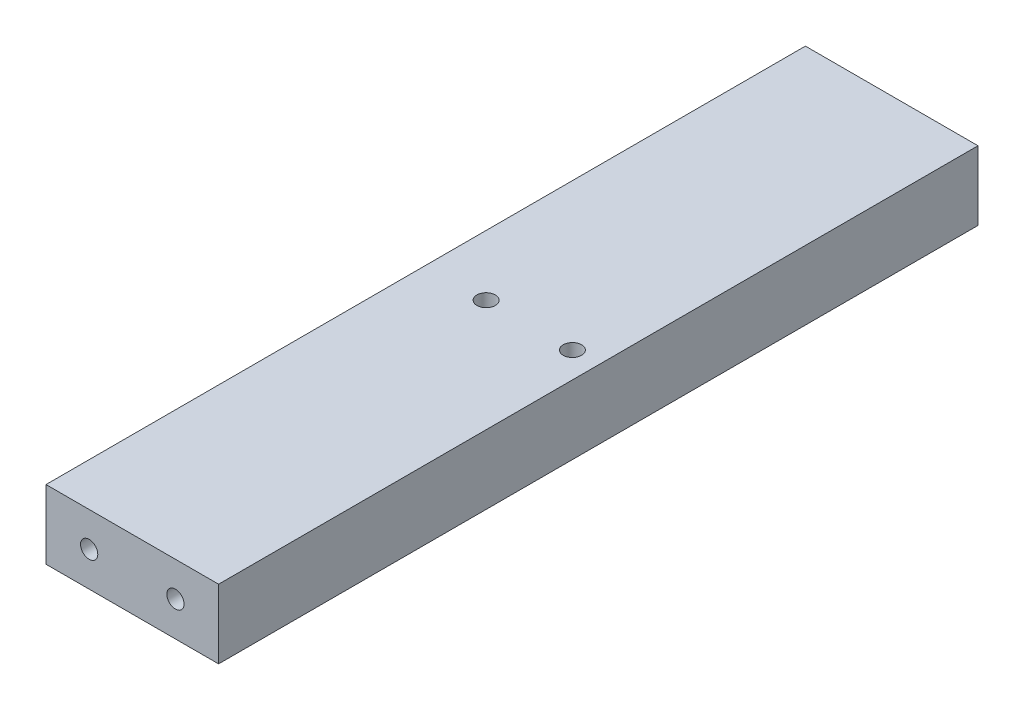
ISO-10303-21;
HEADER;
FILE_DESCRIPTION(('STEP AP214'),'2;1');
FILE_NAME('part.step','',(''),(''),'','','');
FILE_SCHEMA(('AUTOMOTIVE_DESIGN { 1 0 10303 214 1 1 1 1 }'));
ENDSEC;
DATA;
#1=APPLICATION_CONTEXT('core data for automotive mechanical design processes');
#2=APPLICATION_PROTOCOL_DEFINITION('international standard','automotive_design',2000,#1);
#3=PRODUCT_CONTEXT('',#1,'mechanical');
#4=PRODUCT('Part','Part','',(#3));
#5=PRODUCT_RELATED_PRODUCT_CATEGORY('part','',(#4));
#6=PRODUCT_DEFINITION_FORMATION('','',#4);
#7=PRODUCT_DEFINITION_CONTEXT('part definition',#1,'design');
#8=PRODUCT_DEFINITION('design','',#6,#7);
#9=PRODUCT_DEFINITION_SHAPE('','',#8);
#10=(LENGTH_UNIT() NAMED_UNIT(*) SI_UNIT(.MILLI.,.METRE.));
#11=(NAMED_UNIT(*) PLANE_ANGLE_UNIT() SI_UNIT($,.RADIAN.));
#12=(NAMED_UNIT(*) SI_UNIT($,.STERADIAN.) SOLID_ANGLE_UNIT());
#13=UNCERTAINTY_MEASURE_WITH_UNIT(LENGTH_MEASURE(1.E-05),#10,'distance_accuracy_value','');
#14=(GEOMETRIC_REPRESENTATION_CONTEXT(3) GLOBAL_UNCERTAINTY_ASSIGNED_CONTEXT((#13)) GLOBAL_UNIT_ASSIGNED_CONTEXT((#10,
#11,#12)) REPRESENTATION_CONTEXT('',''));
#15=CARTESIAN_POINT('',(0.,0.,0.));
#16=DIRECTION('',(0.,0.,1.));
#17=DIRECTION('',(1.,0.,0.));
#18=AXIS2_PLACEMENT_3D('',#15,#16,#17);
#19=CARTESIAN_POINT('',(0.,-12.7,0.));
#20=DIRECTION('',(0.,-1.,0.));
#21=DIRECTION('',(0.,0.,-1.));
#22=AXIS2_PLACEMENT_3D('',#19,#20,#21);
#23=PLANE('',#22);
#24=CARTESIAN_POINT('',(22.225,-12.7,0.));
#25=DIRECTION('',(0.,-1.,0.));
#26=DIRECTION('',(0.,0.,-1.));
#27=AXIS2_PLACEMENT_3D('',#24,#25,#26);
#28=CIRCLE('',#27,6.4389);
#29=CARTESIAN_POINT('',(22.225,-12.7,-6.4389));
#30=VERTEX_POINT('',#29);
#31=EDGE_CURVE('E364',#30,#30,#28,.T.);
#32=ORIENTED_EDGE('',*,*,#31,.F.);
#33=EDGE_LOOP('',(#32));
#34=FACE_BOUND('',#33,.T.);
#35=CARTESIAN_POINT('',(-9.525,-12.7,0.));
#36=DIRECTION('',(0.,-1.,0.));
#37=DIRECTION('',(0.,0.,-1.));
#38=AXIS2_PLACEMENT_3D('',#35,#36,#37);
#39=CIRCLE('',#38,6.4389);
#40=CARTESIAN_POINT('',(-9.525,-12.7,-6.4389));
#41=VERTEX_POINT('',#40);
#42=EDGE_CURVE('E315',#41,#41,#39,.T.);
#43=ORIENTED_EDGE('',*,*,#42,.F.);
#44=EDGE_LOOP('',(#43));
#45=FACE_BOUND('',#44,.T.);
#46=CARTESIAN_POINT('',(-15.875,-12.7,120.65));
#47=DIRECTION('',(0.,1.,0.));
#48=DIRECTION('',(0.,0.,1.));
#49=AXIS2_PLACEMENT_3D('',#46,#47,#48);
#50=CIRCLE('',#49,5.);
#51=CARTESIAN_POINT('',(-15.875,-12.7,125.65));
#52=VERTEX_POINT('',#51);
#53=EDGE_CURVE('E323',#52,#52,#50,.T.);
#54=ORIENTED_EDGE('',*,*,#53,.T.);
#55=EDGE_LOOP('',(#54));
#56=FACE_BOUND('',#55,.T.);
#57=CARTESIAN_POINT('',(15.875,-12.7,-120.65));
#58=DIRECTION('',(0.,-1.,0.));
#59=DIRECTION('',(0.,0.,-1.));
#60=AXIS2_PLACEMENT_3D('',#57,#58,#59);
#61=CIRCLE('',#60,5.);
#62=CARTESIAN_POINT('',(15.875,-12.7,-125.65));
#63=VERTEX_POINT('',#62);
#64=EDGE_CURVE('E127',#63,#63,#61,.T.);
#65=ORIENTED_EDGE('',*,*,#64,.F.);
#66=EDGE_LOOP('',(#65));
#67=FACE_BOUND('',#66,.T.);
#68=CARTESIAN_POINT('',(-15.875,-12.7,-120.65));
#69=DIRECTION('',(0.,-1.,0.));
#70=DIRECTION('',(0.,0.,-1.));
#71=AXIS2_PLACEMENT_3D('',#68,#69,#70);
#72=CIRCLE('',#71,5.);
#73=CARTESIAN_POINT('',(-15.875,-12.7,-125.65));
#74=VERTEX_POINT('',#73);
#75=EDGE_CURVE('E138',#74,#74,#72,.T.);
#76=ORIENTED_EDGE('',*,*,#75,.F.);
#77=EDGE_LOOP('',(#76));
#78=FACE_BOUND('',#77,.T.);
#79=DIRECTION('',(0.,0.,-1.));
#80=VECTOR('',#79,1.);
#81=CARTESIAN_POINT('',(31.75,-12.7,139.7));
#82=LINE('',#81,#80);
#83=CARTESIAN_POINT('',(31.75,-12.7,139.7));
#84=VERTEX_POINT('',#83);
#85=CARTESIAN_POINT('',(31.75,-12.7,-139.7));
#86=VERTEX_POINT('',#85);
#87=EDGE_CURVE('E155',#84,#86,#82,.T.);
#88=ORIENTED_EDGE('',*,*,#87,.F.);
#89=DIRECTION('',(1.,0.,0.));
#90=VECTOR('',#89,1.);
#91=CARTESIAN_POINT('',(-31.75,-12.7,139.7));
#92=LINE('',#91,#90);
#93=CARTESIAN_POINT('',(-31.75,-12.7,139.7));
#94=VERTEX_POINT('',#93);
#95=EDGE_CURVE('E84',#94,#84,#92,.T.);
#96=ORIENTED_EDGE('',*,*,#95,.F.);
#97=DIRECTION('',(0.,0.,1.));
#98=VECTOR('',#97,1.);
#99=CARTESIAN_POINT('',(-31.75,-12.7,139.7));
#100=LINE('',#99,#98);
#101=CARTESIAN_POINT('',(-31.75,-12.7,-139.7));
#102=VERTEX_POINT('',#101);
#103=EDGE_CURVE('E78',#102,#94,#100,.T.);
#104=ORIENTED_EDGE('',*,*,#103,.F.);
#105=DIRECTION('',(-1.,0.,0.));
#106=VECTOR('',#105,1.);
#107=CARTESIAN_POINT('',(-31.75,-12.7,-139.7));
#108=LINE('',#107,#106);
#109=EDGE_CURVE('E165',#86,#102,#108,.T.);
#110=ORIENTED_EDGE('',*,*,#109,.F.);
#111=EDGE_LOOP('',(#88,#96,#104,#110));
#112=FACE_BOUND('',#111,.T.);
#113=CARTESIAN_POINT('',(15.875,-12.7,120.65));
#114=DIRECTION('',(0.,1.,0.));
#115=DIRECTION('',(0.,0.,1.));
#116=AXIS2_PLACEMENT_3D('',#113,#114,#115);
#117=CIRCLE('',#116,5.);
#118=CARTESIAN_POINT('',(15.875,-12.7,125.65));
#119=VERTEX_POINT('',#118);
#120=EDGE_CURVE('E308',#119,#119,#117,.T.);
#121=ORIENTED_EDGE('',*,*,#120,.T.);
#122=EDGE_LOOP('',(#121));
#123=FACE_BOUND('',#122,.T.);
#124=ADVANCED_FACE('F37',(#34,#45,#56,#67,#78,#112,#123),#23,.T.);
#125=CARTESIAN_POINT('',(15.875,0.,139.7));
#126=DIRECTION('',(0.,0.,1.));
#127=DIRECTION('',(1.,0.,0.));
#128=AXIS2_PLACEMENT_3D('',#125,#126,#127);
#129=CYLINDRICAL_SURFACE('',#128,3.17499999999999);
#130=CARTESIAN_POINT('',(15.875,0.,139.7));
#131=DIRECTION('',(0.,0.,1.));
#132=DIRECTION('',(1.,0.,0.));
#133=AXIS2_PLACEMENT_3D('',#130,#131,#132);
#134=CIRCLE('',#133,3.17499999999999);
#135=CARTESIAN_POINT('',(19.05,0.,139.7));
#136=VERTEX_POINT('',#135);
#137=EDGE_CURVE('E115',#136,#136,#134,.T.);
#138=ORIENTED_EDGE('',*,*,#137,.T.);
#139=EDGE_LOOP('',(#138));
#140=FACE_BOUND('',#139,.T.);
#141=CARTESIAN_POINT('',(19.05,0.,124.512560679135));
#142=CARTESIAN_POINT('',(19.0500000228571,0.0786051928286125,124.512560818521));
#143=CARTESIAN_POINT('',(19.0470754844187,0.157216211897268,124.514970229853));
#144=CARTESIAN_POINT('',(19.0354348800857,0.313753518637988,124.524494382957));
#145=CARTESIAN_POINT('',(19.0267157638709,0.391679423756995,124.531611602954));
#146=CARTESIAN_POINT('',(19.0036259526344,0.546301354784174,124.550246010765));
#147=CARTESIAN_POINT('',(18.9892447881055,0.622994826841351,124.561771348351));
#148=CARTESIAN_POINT('',(18.9550725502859,0.774478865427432,124.588733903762));
#149=CARTESIAN_POINT('',(18.9352787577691,0.849268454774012,124.604173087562));
#150=CARTESIAN_POINT('',(18.8686031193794,1.06871879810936,124.655178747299));
#151=CARTESIAN_POINT('',(18.8141851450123,1.21002402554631,124.695641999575));
#152=CARTESIAN_POINT('',(18.6873091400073,1.48122354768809,124.784841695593));
#153=CARTESIAN_POINT('',(18.6148496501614,1.61111691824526,124.833578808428));
#154=CARTESIAN_POINT('',(18.442179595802,1.87576643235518,124.942010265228));
#155=CARTESIAN_POINT('',(18.3395110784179,2.00868659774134,125.002285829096));
#156=CARTESIAN_POINT('',(18.1143927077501,2.25696567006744,125.122298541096));
#157=CARTESIAN_POINT('',(17.9919254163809,2.37230892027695,125.182035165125));
#158=CARTESIAN_POINT('',(17.7118400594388,2.59666122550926,125.303172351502));
#159=CARTESIAN_POINT('',(17.5517371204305,2.70303960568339,125.363833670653));
#160=CARTESIAN_POINT('',(17.2966946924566,2.84055848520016,125.444454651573));
#161=CARTESIAN_POINT('',(17.2091723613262,2.882732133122,125.469605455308));
#162=CARTESIAN_POINT('',(17.0297105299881,2.95918210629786,125.515716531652));
#163=CARTESIAN_POINT('',(16.9377741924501,2.99346398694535,125.53667975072));
#164=CARTESIAN_POINT('',(16.7599575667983,3.05045395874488,125.571808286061));
#165=CARTESIAN_POINT('',(16.6744374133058,3.07399342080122,125.586453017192));
#166=CARTESIAN_POINT('',(16.5011655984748,3.11391059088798,125.611408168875));
#167=CARTESIAN_POINT('',(16.4134152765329,3.13029249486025,125.621721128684));
#168=CARTESIAN_POINT('',(16.236479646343,3.1556194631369,125.637706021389));
#169=CARTESIAN_POINT('',(16.1472953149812,3.16456938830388,125.643380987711));
#170=CARTESIAN_POINT('',(15.9683453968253,3.17489485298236,125.649932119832));
#171=CARTESIAN_POINT('',(15.878579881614,3.17627130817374,125.650808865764));
#172=CARTESIAN_POINT('',(15.6345890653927,3.16963566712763,125.64659114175));
#173=CARTESIAN_POINT('',(15.4805620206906,3.15413714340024,125.636734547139));
#174=CARTESIAN_POINT('',(15.1779167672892,3.1013469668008,125.60351602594));
#175=CARTESIAN_POINT('',(15.0292989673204,3.06405367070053,125.580153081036));
#176=CARTESIAN_POINT('',(14.7408557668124,2.96941239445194,125.521898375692));
#177=CARTESIAN_POINT('',(14.6010405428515,2.91204168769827,125.486993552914));
#178=CARTESIAN_POINT('',(14.33294617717,2.77940533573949,125.40832140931));
#179=CARTESIAN_POINT('',(14.2046695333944,2.70413582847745,125.364552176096));
#180=CARTESIAN_POINT('',(13.9458966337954,2.52720474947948,125.265203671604));
#181=CARTESIAN_POINT('',(13.8171656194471,2.42341069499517,125.208831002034));
#182=CARTESIAN_POINT('',(13.5778202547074,2.19788263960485,125.093049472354));
#183=CARTESIAN_POINT('',(13.467233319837,2.07612200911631,125.033636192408));
#184=CARTESIAN_POINT('',(13.251934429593,1.79863441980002,124.90875757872));
#185=CARTESIAN_POINT('',(13.1500859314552,1.640539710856,124.8435734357));
#186=CARTESIAN_POINT('',(12.9747233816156,1.30559847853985,124.724269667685));
#187=CARTESIAN_POINT('',(12.9011576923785,1.12878688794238,124.670129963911));
#188=CARTESIAN_POINT('',(12.8017359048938,0.809691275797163,124.594345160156));
#189=CARTESIAN_POINT('',(12.7683710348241,0.670900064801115,124.567877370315));
#190=CARTESIAN_POINT('',(12.7205751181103,0.388205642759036,124.529507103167));
#191=CARTESIAN_POINT('',(12.7061165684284,0.244310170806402,124.517583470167));
#192=CARTESIAN_POINT('',(12.6970139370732,-0.0449417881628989,124.510110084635));
#193=CARTESIAN_POINT('',(12.7024237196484,-0.190301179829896,124.514604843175));
#194=CARTESIAN_POINT('',(12.732803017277,-0.477634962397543,124.53933857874));
#195=CARTESIAN_POINT('',(12.757788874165,-0.619606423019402,124.559590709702));
#196=CARTESIAN_POINT('',(12.825056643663,-0.893243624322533,124.612271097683));
#197=CARTESIAN_POINT('',(12.8669191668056,-1.02507297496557,124.64440264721));
#198=CARTESIAN_POINT('',(12.9662675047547,-1.28009948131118,124.717316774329));
#199=CARTESIAN_POINT('',(13.0237587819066,-1.40329359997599,124.758102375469));
#200=CARTESIAN_POINT('',(13.1655245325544,-1.66291110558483,124.853254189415));
#201=CARTESIAN_POINT('',(13.252829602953,-1.79727673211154,124.908720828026));
#202=CARTESIAN_POINT('',(13.4460594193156,-2.05094077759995,125.021822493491));
#203=CARTESIAN_POINT('',(13.552003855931,-2.17022303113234,125.079459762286));
#204=CARTESIAN_POINT('',(13.8012999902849,-2.41151290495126,125.202161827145));
#205=CARTESIAN_POINT('',(13.9479525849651,-2.53040838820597,125.26678213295));
#206=CARTESIAN_POINT('',(14.183939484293,-2.68885560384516,125.356106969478));
#207=CARTESIAN_POINT('',(14.2653162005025,-2.73837587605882,125.384627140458));
#208=CARTESIAN_POINT('',(14.4330211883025,-2.83027345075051,125.438363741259));
#209=CARTESIAN_POINT('',(14.5193463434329,-2.87265518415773,125.463582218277));
#210=CARTESIAN_POINT('',(14.6917775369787,-2.94770848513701,125.508756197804));
#211=CARTESIAN_POINT('',(14.7776590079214,-2.98077190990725,125.528917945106));
#212=CARTESIAN_POINT('',(14.952732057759,-3.03950048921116,125.565017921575));
#213=CARTESIAN_POINT('',(15.0419216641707,-3.06516997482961,125.580958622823));
#214=CARTESIAN_POINT('',(15.2228061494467,-3.1086834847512,125.608124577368));
#215=CARTESIAN_POINT('',(15.3144985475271,-3.12653497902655,125.619354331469));
#216=CARTESIAN_POINT('',(15.4995666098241,-3.15411195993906,125.636750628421));
#217=CARTESIAN_POINT('',(15.5929419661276,-3.16383891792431,125.642918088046));
#218=CARTESIAN_POINT('',(15.7659988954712,-3.17412435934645,125.649442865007));
#219=CARTESIAN_POINT('',(15.8455851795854,-3.17585983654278,125.650545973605));
#220=CARTESIAN_POINT('',(16.0046533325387,-3.17334895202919,125.64895162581));
#221=CARTESIAN_POINT('',(16.0841351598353,-3.16910067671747,125.64625295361));
#222=CARTESIAN_POINT('',(16.242306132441,-3.15468105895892,125.637118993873));
#223=CARTESIAN_POINT('',(16.3209956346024,-3.14451251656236,125.630685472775));
#224=CARTESIAN_POINT('',(16.4770420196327,-3.11840350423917,125.614243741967));
#225=CARTESIAN_POINT('',(16.554398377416,-3.10246081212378,125.604234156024));
#226=CARTESIAN_POINT('',(16.7769860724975,-3.04789097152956,125.570183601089));
#227=CARTESIAN_POINT('',(16.9197957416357,-3.00183434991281,125.541670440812));
#228=CARTESIAN_POINT('',(17.1953924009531,-2.89124507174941,125.474598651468));
#229=CARTESIAN_POINT('',(17.3281778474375,-2.82670957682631,125.43603847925));
#230=CARTESIAN_POINT('',(17.5946287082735,-2.67383717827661,125.347287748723));
#231=CARTESIAN_POINT('',(17.7270311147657,-2.58375576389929,125.296316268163));
#232=CARTESIAN_POINT('',(17.9757385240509,-2.38596377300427,125.189303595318));
#233=CARTESIAN_POINT('',(18.0920256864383,-2.2782339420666,125.133256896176));
#234=CARTESIAN_POINT('',(18.323335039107,-2.02960502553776,125.01178312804));
#235=CARTESIAN_POINT('',(18.4355502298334,-1.88615445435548,124.94621021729));
#236=CARTESIAN_POINT('',(18.6348091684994,-1.58029559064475,124.82100749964));
#237=CARTESIAN_POINT('',(18.721863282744,-1.41789514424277,124.761375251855));
#238=CARTESIAN_POINT('',(18.8519155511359,-1.11344930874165,124.667829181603));
#239=CARTESIAN_POINT('',(18.9003689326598,-0.974589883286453,124.631142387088));
#240=CARTESIAN_POINT('',(18.9778443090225,-0.688991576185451,124.5710726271));
#241=CARTESIAN_POINT('',(19.0069253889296,-0.542278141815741,124.547649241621));
#242=CARTESIAN_POINT('',(19.033643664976,-0.328513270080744,124.525958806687));
#243=CARTESIAN_POINT('',(19.039766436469,-0.263084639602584,124.520952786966));
#244=CARTESIAN_POINT('',(19.0479451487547,-0.131772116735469,124.514253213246));
#245=CARTESIAN_POINT('',(19.0499999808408,-0.065888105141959,124.512560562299));
#246=CARTESIAN_POINT('',(19.05,0.,124.512560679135));
#247=B_SPLINE_CURVE_WITH_KNOTS('',3,(#141,#142,#143,#144,#145,#146,#147,#148,#149,#150,#151,
#152,#153,#154,#155,#156,#157,#158,#159,#160,#161,#162,#163,#164,#165,#166,#167,#168,#169,#170,
#171,#172,#173,#174,#175,#176,#177,#178,#179,#180,#181,#182,#183,#184,#185,#186,#187,#188,#189,
#190,#191,#192,#193,#194,#195,#196,#197,#198,#199,#200,#201,#202,#203,#204,#205,#206,#207,#208,
#209,#210,#211,#212,#213,#214,#215,#216,#217,#218,#219,#220,#221,#222,#223,#224,#225,#226,#227,
#228,#229,#230,#231,#232,#233,#234,#235,#236,#237,#238,#239,#240,#241,#242,#243,#244,#245,#246),
.UNSPECIFIED.,.T.,.F.,(4,2,2,2,2,2,2,2,2,2,2,2,2,2,2,2,2,2,2,2,2,2,2,2,2,2,2,2,2,2,2,2,2,2,2,2,
2,2,2,2,2,2,2,2,2,2,2,2,2,2,2,2,4),(0.,0.23573560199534,0.471595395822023,0.707893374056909,
0.944310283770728,1.41241991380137,1.88056741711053,2.41382087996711,2.94754659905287,
3.54854251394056,3.84921053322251,4.14966624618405,4.41897643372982,4.6881285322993,
4.95710445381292,5.22604785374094,5.68894068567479,6.15186842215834,6.61532187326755,
7.07887541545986,7.60096577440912,8.12383788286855,8.71809709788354,9.31126612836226,
9.74500528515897,10.1781127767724,10.6123953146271,11.0470407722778,11.471492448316,
11.8960926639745,12.4029141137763,12.9102742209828,13.5055867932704,13.8035526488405,
14.1013328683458,14.383542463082,14.665586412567,14.9473602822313,15.2290831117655,
15.4676151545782,15.7062234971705,15.9447190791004,16.1833065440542,16.6394302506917,
17.0956240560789,17.5978466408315,18.1006208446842,18.6788222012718,19.2567849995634,
19.7098416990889,20.1615101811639,20.3590536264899,20.5566509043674),.UNSPECIFIED.);
#248=CARTESIAN_POINT('',(19.05,0.,124.512560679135));
#249=VERTEX_POINT('',#248);
#250=EDGE_CURVE('E240',#249,#249,#247,.T.);
#251=ORIENTED_EDGE('',*,*,#250,.F.);
#252=EDGE_LOOP('',(#251));
#253=FACE_BOUND('',#252,.T.);
#254=ADVANCED_FACE('F252',(#140,#253),#129,.F.);
#255=CARTESIAN_POINT('',(-15.875,0.,139.7));
#256=DIRECTION('',(0.,0.,1.));
#257=DIRECTION('',(1.,0.,0.));
#258=AXIS2_PLACEMENT_3D('',#255,#256,#257);
#259=CYLINDRICAL_SURFACE('',#258,3.17499999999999);
#260=CARTESIAN_POINT('',(-15.875,0.,139.7));
#261=DIRECTION('',(0.,0.,1.));
#262=DIRECTION('',(1.,0.,0.));
#263=AXIS2_PLACEMENT_3D('',#260,#261,#262);
#264=CIRCLE('',#263,3.17499999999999);
#265=CARTESIAN_POINT('',(-12.7,0.,139.7));
#266=VERTEX_POINT('',#265);
#267=EDGE_CURVE('E114',#266,#266,#264,.T.);
#268=ORIENTED_EDGE('',*,*,#267,.T.);
#269=EDGE_LOOP('',(#268));
#270=FACE_BOUND('',#269,.T.);
#271=CARTESIAN_POINT('',(-12.7,0.,124.512560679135));
#272=CARTESIAN_POINT('',(-12.6999999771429,0.0786051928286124,124.512560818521));
#273=CARTESIAN_POINT('',(-12.7029245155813,0.157216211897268,124.514970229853));
#274=CARTESIAN_POINT('',(-12.7145651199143,0.313753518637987,124.524494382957));
#275=CARTESIAN_POINT('',(-12.7232842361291,0.391679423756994,124.531611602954));
#276=CARTESIAN_POINT('',(-12.7463740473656,0.546301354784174,124.550246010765));
#277=CARTESIAN_POINT('',(-12.7607552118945,0.622994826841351,124.561771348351));
#278=CARTESIAN_POINT('',(-12.7949274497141,0.774478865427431,124.588733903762));
#279=CARTESIAN_POINT('',(-12.8147212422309,0.849268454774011,124.604173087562));
#280=CARTESIAN_POINT('',(-12.8813968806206,1.06871879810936,124.655178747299));
#281=CARTESIAN_POINT('',(-12.9358148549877,1.21002402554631,124.695641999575));
#282=CARTESIAN_POINT('',(-13.0626908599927,1.48122354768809,124.784841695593));
#283=CARTESIAN_POINT('',(-13.1351503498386,1.61111691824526,124.833578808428));
#284=CARTESIAN_POINT('',(-13.307820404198,1.87576643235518,124.942010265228));
#285=CARTESIAN_POINT('',(-13.4104889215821,2.00868659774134,125.002285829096));
#286=CARTESIAN_POINT('',(-13.6356072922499,2.25696567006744,125.122298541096));
#287=CARTESIAN_POINT('',(-13.7580745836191,2.37230892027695,125.182035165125));
#288=CARTESIAN_POINT('',(-14.0381599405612,2.59666122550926,125.303172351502));
#289=CARTESIAN_POINT('',(-14.1982628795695,2.70303960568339,125.363833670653));
#290=CARTESIAN_POINT('',(-14.4533053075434,2.84055848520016,125.444454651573));
#291=CARTESIAN_POINT('',(-14.5408276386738,2.882732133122,125.469605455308));
#292=CARTESIAN_POINT('',(-14.7202894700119,2.95918210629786,125.515716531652));
#293=CARTESIAN_POINT('',(-14.8122258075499,2.99346398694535,125.53667975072));
#294=CARTESIAN_POINT('',(-14.9900424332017,3.05045395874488,125.571808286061));
#295=CARTESIAN_POINT('',(-15.0755625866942,3.07399342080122,125.586453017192));
#296=CARTESIAN_POINT('',(-15.2488344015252,3.11391059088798,125.611408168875));
#297=CARTESIAN_POINT('',(-15.3365847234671,3.13029249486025,125.621721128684));
#298=CARTESIAN_POINT('',(-15.513520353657,3.1556194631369,125.637706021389));
#299=CARTESIAN_POINT('',(-15.6027046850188,3.16456938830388,125.643380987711));
#300=CARTESIAN_POINT('',(-15.7816546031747,3.17489485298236,125.649932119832));
#301=CARTESIAN_POINT('',(-15.871420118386,3.17627130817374,125.650808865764));
#302=CARTESIAN_POINT('',(-16.1154109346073,3.16963566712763,125.64659114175));
#303=CARTESIAN_POINT('',(-16.2694379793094,3.15413714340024,125.636734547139));
#304=CARTESIAN_POINT('',(-16.5720832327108,3.1013469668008,125.60351602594));
#305=CARTESIAN_POINT('',(-16.7207010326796,3.06405367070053,125.580153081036));
#306=CARTESIAN_POINT('',(-17.0091442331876,2.96941239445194,125.521898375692));
#307=CARTESIAN_POINT('',(-17.1489594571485,2.91204168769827,125.486993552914));
#308=CARTESIAN_POINT('',(-17.41705382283,2.7794053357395,125.40832140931));
#309=CARTESIAN_POINT('',(-17.5453304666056,2.70413582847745,125.364552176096));
#310=CARTESIAN_POINT('',(-17.8041033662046,2.52720474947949,125.265203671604));
#311=CARTESIAN_POINT('',(-17.9328343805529,2.42341069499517,125.208831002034));
#312=CARTESIAN_POINT('',(-18.1721797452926,2.19788263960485,125.093049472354));
#313=CARTESIAN_POINT('',(-18.282766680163,2.07612200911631,125.033636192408));
#314=CARTESIAN_POINT('',(-18.498065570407,1.79863441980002,124.90875757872));
#315=CARTESIAN_POINT('',(-18.5999140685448,1.640539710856,124.8435734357));
#316=CARTESIAN_POINT('',(-18.7752766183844,1.30559847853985,124.724269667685));
#317=CARTESIAN_POINT('',(-18.8488423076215,1.12878688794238,124.670129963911));
#318=CARTESIAN_POINT('',(-18.9482640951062,0.809691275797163,124.594345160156));
#319=CARTESIAN_POINT('',(-18.9816289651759,0.670900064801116,124.567877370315));
#320=CARTESIAN_POINT('',(-19.0294248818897,0.388205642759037,124.529507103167));
#321=CARTESIAN_POINT('',(-19.0438834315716,0.244310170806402,124.517583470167));
#322=CARTESIAN_POINT('',(-19.0529860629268,-0.0449417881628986,124.510110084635));
#323=CARTESIAN_POINT('',(-19.0475762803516,-0.190301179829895,124.514604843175));
#324=CARTESIAN_POINT('',(-19.017196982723,-0.477634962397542,124.53933857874));
#325=CARTESIAN_POINT('',(-18.992211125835,-0.619606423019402,124.559590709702));
#326=CARTESIAN_POINT('',(-18.924943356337,-0.893243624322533,124.612271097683));
#327=CARTESIAN_POINT('',(-18.8830808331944,-1.02507297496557,124.64440264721));
#328=CARTESIAN_POINT('',(-18.7837324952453,-1.28009948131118,124.717316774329));
#329=CARTESIAN_POINT('',(-18.7262412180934,-1.40329359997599,124.758102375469));
#330=CARTESIAN_POINT('',(-18.5844754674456,-1.66291110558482,124.853254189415));
#331=CARTESIAN_POINT('',(-18.497170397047,-1.79727673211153,124.908720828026));
#332=CARTESIAN_POINT('',(-18.3039405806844,-2.05094077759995,125.021822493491));
#333=CARTESIAN_POINT('',(-18.197996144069,-2.17022303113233,125.079459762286));
#334=CARTESIAN_POINT('',(-17.9487000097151,-2.41151290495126,125.202161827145));
#335=CARTESIAN_POINT('',(-17.8020474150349,-2.53040838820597,125.26678213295));
#336=CARTESIAN_POINT('',(-17.566060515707,-2.68885560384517,125.356106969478));
#337=CARTESIAN_POINT('',(-17.4846837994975,-2.73837587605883,125.384627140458));
#338=CARTESIAN_POINT('',(-17.3169788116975,-2.83027345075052,125.438363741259));
#339=CARTESIAN_POINT('',(-17.2306536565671,-2.87265518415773,125.463582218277));
#340=CARTESIAN_POINT('',(-17.0582224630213,-2.94770848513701,125.508756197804));
#341=CARTESIAN_POINT('',(-16.9723409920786,-2.98077190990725,125.528917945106));
#342=CARTESIAN_POINT('',(-16.797267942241,-3.03950048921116,125.565017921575));
#343=CARTESIAN_POINT('',(-16.7080783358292,-3.06516997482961,125.580958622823));
#344=CARTESIAN_POINT('',(-16.5271938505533,-3.1086834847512,125.608124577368));
#345=CARTESIAN_POINT('',(-16.4355014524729,-3.12653497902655,125.619354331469));
#346=CARTESIAN_POINT('',(-16.2504333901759,-3.15411195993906,125.636750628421));
#347=CARTESIAN_POINT('',(-16.1570580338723,-3.16383891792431,125.642918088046));
#348=CARTESIAN_POINT('',(-15.9840011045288,-3.17412435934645,125.649442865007));
#349=CARTESIAN_POINT('',(-15.9044148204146,-3.17585983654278,125.650545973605));
#350=CARTESIAN_POINT('',(-15.7453466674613,-3.17334895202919,125.64895162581));
#351=CARTESIAN_POINT('',(-15.6658648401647,-3.16910067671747,125.64625295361));
#352=CARTESIAN_POINT('',(-15.507693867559,-3.15468105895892,125.637118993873));
#353=CARTESIAN_POINT('',(-15.4290043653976,-3.14451251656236,125.630685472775));
#354=CARTESIAN_POINT('',(-15.2729579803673,-3.11840350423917,125.614243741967));
#355=CARTESIAN_POINT('',(-15.195601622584,-3.10246081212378,125.604234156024));
#356=CARTESIAN_POINT('',(-14.9730139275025,-3.04789097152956,125.570183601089));
#357=CARTESIAN_POINT('',(-14.8302042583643,-3.00183434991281,125.541670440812));
#358=CARTESIAN_POINT('',(-14.5546075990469,-2.89124507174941,125.474598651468));
#359=CARTESIAN_POINT('',(-14.4218221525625,-2.82670957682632,125.43603847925));
#360=CARTESIAN_POINT('',(-14.1553712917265,-2.67383717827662,125.347287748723));
#361=CARTESIAN_POINT('',(-14.0229688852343,-2.5837557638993,125.296316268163));
#362=CARTESIAN_POINT('',(-13.7742614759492,-2.38596377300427,125.189303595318));
#363=CARTESIAN_POINT('',(-13.6579743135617,-2.2782339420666,125.133256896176));
#364=CARTESIAN_POINT('',(-13.426664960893,-2.02960502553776,125.01178312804));
#365=CARTESIAN_POINT('',(-13.3144497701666,-1.88615445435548,124.94621021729));
#366=CARTESIAN_POINT('',(-13.1151908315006,-1.58029559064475,124.82100749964));
#367=CARTESIAN_POINT('',(-13.028136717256,-1.41789514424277,124.761375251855));
#368=CARTESIAN_POINT('',(-12.8980844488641,-1.11344930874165,124.667829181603));
#369=CARTESIAN_POINT('',(-12.8496310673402,-0.974589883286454,124.631142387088));
#370=CARTESIAN_POINT('',(-12.7721556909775,-0.688991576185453,124.5710726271));
#371=CARTESIAN_POINT('',(-12.7430746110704,-0.542278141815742,124.547649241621));
#372=CARTESIAN_POINT('',(-12.716356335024,-0.328513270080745,124.525958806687));
#373=CARTESIAN_POINT('',(-12.710233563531,-0.263084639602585,124.520952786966));
#374=CARTESIAN_POINT('',(-12.7020548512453,-0.13177211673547,124.514253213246));
#375=CARTESIAN_POINT('',(-12.7000000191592,-0.0658881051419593,124.512560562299));
#376=CARTESIAN_POINT('',(-12.7,0.,124.512560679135));
#377=B_SPLINE_CURVE_WITH_KNOTS('',3,(#271,#272,#273,#274,#275,#276,#277,#278,#279,#280,#281,
#282,#283,#284,#285,#286,#287,#288,#289,#290,#291,#292,#293,#294,#295,#296,#297,#298,#299,#300,
#301,#302,#303,#304,#305,#306,#307,#308,#309,#310,#311,#312,#313,#314,#315,#316,#317,#318,#319,
#320,#321,#322,#323,#324,#325,#326,#327,#328,#329,#330,#331,#332,#333,#334,#335,#336,#337,#338,
#339,#340,#341,#342,#343,#344,#345,#346,#347,#348,#349,#350,#351,#352,#353,#354,#355,#356,#357,
#358,#359,#360,#361,#362,#363,#364,#365,#366,#367,#368,#369,#370,#371,#372,#373,#374,#375,#376),
.UNSPECIFIED.,.T.,.F.,(4,2,2,2,2,2,2,2,2,2,2,2,2,2,2,2,2,2,2,2,2,2,2,2,2,2,2,2,2,2,2,2,2,2,2,2,
2,2,2,2,2,2,2,2,2,2,2,2,2,2,2,2,4),(0.,0.23573560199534,0.471595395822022,0.707893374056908,
0.944310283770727,1.41241991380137,1.88056741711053,2.41382087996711,2.94754659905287,
3.54854251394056,3.84921053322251,4.14966624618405,4.41897643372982,4.6881285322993,
4.95710445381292,5.22604785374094,5.68894068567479,6.15186842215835,6.61532187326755,
7.07887541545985,7.60096577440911,8.12383788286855,8.71809709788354,9.31126612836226,
9.74500528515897,10.1781127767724,10.6123953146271,11.0470407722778,11.471492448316,
11.8960926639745,12.4029141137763,12.9102742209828,13.5055867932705,13.8035526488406,
14.1013328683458,14.383542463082,14.665586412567,14.9473602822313,15.2290831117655,
15.4676151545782,15.7062234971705,15.9447190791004,16.1833065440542,16.6394302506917,
17.0956240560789,17.5978466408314,18.1006208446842,18.6788222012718,19.2567849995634,
19.7098416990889,20.1615101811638,20.3590536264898,20.5566509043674),.UNSPECIFIED.);
#378=CARTESIAN_POINT('',(-12.7,0.,124.512560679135));
#379=VERTEX_POINT('',#378);
#380=EDGE_CURVE('E209',#379,#379,#377,.T.);
#381=ORIENTED_EDGE('',*,*,#380,.F.);
#382=EDGE_LOOP('',(#381));
#383=FACE_BOUND('',#382,.T.);
#384=ADVANCED_FACE('F235',(#270,#383),#259,.F.);
#385=CARTESIAN_POINT('',(31.75,12.7,139.7));
#386=DIRECTION('',(-1.,0.,0.));
#387=DIRECTION('',(0.,0.,1.));
#388=AXIS2_PLACEMENT_3D('',#385,#386,#387);
#389=PLANE('',#388);
#390=ORIENTED_EDGE('',*,*,#87,.T.);
#391=DIRECTION('',(0.,-1.,0.));
#392=VECTOR('',#391,1.);
#393=CARTESIAN_POINT('',(31.75,12.7,-139.7));
#394=LINE('',#393,#392);
#395=CARTESIAN_POINT('',(31.75,12.7,-139.7));
#396=VERTEX_POINT('',#395);
#397=EDGE_CURVE('E11',#396,#86,#394,.T.);
#398=ORIENTED_EDGE('',*,*,#397,.F.);
#399=DIRECTION('',(0.,0.,-1.));
#400=VECTOR('',#399,1.);
#401=CARTESIAN_POINT('',(31.75,12.7,139.7));
#402=LINE('',#401,#400);
#403=CARTESIAN_POINT('',(31.75,12.7,139.7));
#404=VERTEX_POINT('',#403);
#405=EDGE_CURVE('E156',#404,#396,#402,.T.);
#406=ORIENTED_EDGE('',*,*,#405,.F.);
#407=DIRECTION('',(0.,-1.,0.));
#408=VECTOR('',#407,1.);
#409=CARTESIAN_POINT('',(31.75,12.7,139.7));
#410=LINE('',#409,#408);
#411=EDGE_CURVE('E162',#404,#84,#410,.T.);
#412=ORIENTED_EDGE('',*,*,#411,.T.);
#413=EDGE_LOOP('',(#390,#398,#406,#412));
#414=FACE_BOUND('',#413,.T.);
#415=ADVANCED_FACE('F39',(#414),#389,.F.);
#416=CARTESIAN_POINT('',(-31.75,12.7,-139.7));
#417=DIRECTION('',(0.,0.,1.));
#418=DIRECTION('',(1.,0.,0.));
#419=AXIS2_PLACEMENT_3D('',#416,#417,#418);
#420=PLANE('',#419);
#421=CARTESIAN_POINT('',(15.875,0.,-139.7));
#422=DIRECTION('',(0.,0.,-1.));
#423=DIRECTION('',(-1.,0.,0.));
#424=AXIS2_PLACEMENT_3D('',#421,#422,#423);
#425=CIRCLE('',#424,3.17499999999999);
#426=CARTESIAN_POINT('',(12.7,0.,-139.7));
#427=VERTEX_POINT('',#426);
#428=EDGE_CURVE('E142',#427,#427,#425,.T.);
#429=ORIENTED_EDGE('',*,*,#428,.F.);
#430=EDGE_LOOP('',(#429));
#431=FACE_BOUND('',#430,.T.);
#432=CARTESIAN_POINT('',(-15.875,0.,-139.7));
#433=DIRECTION('',(0.,0.,-1.));
#434=DIRECTION('',(-1.,0.,0.));
#435=AXIS2_PLACEMENT_3D('',#432,#433,#434);
#436=CIRCLE('',#435,3.17499999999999);
#437=CARTESIAN_POINT('',(-19.05,0.,-139.7));
#438=VERTEX_POINT('',#437);
#439=EDGE_CURVE('E149',#438,#438,#436,.T.);
#440=ORIENTED_EDGE('',*,*,#439,.F.);
#441=EDGE_LOOP('',(#440));
#442=FACE_BOUND('',#441,.T.);
#443=ORIENTED_EDGE('',*,*,#109,.T.);
#444=DIRECTION('',(0.,-1.,0.));
#445=VECTOR('',#444,1.);
#446=CARTESIAN_POINT('',(-31.75,12.7,-139.7));
#447=LINE('',#446,#445);
#448=CARTESIAN_POINT('',(-31.75,12.7,-139.7));
#449=VERTEX_POINT('',#448);
#450=EDGE_CURVE('E51',#449,#102,#447,.T.);
#451=ORIENTED_EDGE('',*,*,#450,.F.);
#452=DIRECTION('',(-1.,0.,0.));
#453=VECTOR('',#452,1.);
#454=CARTESIAN_POINT('',(-31.75,12.7,-139.7));
#455=LINE('',#454,#453);
#456=EDGE_CURVE('E91',#396,#449,#455,.T.);
#457=ORIENTED_EDGE('',*,*,#456,.F.);
#458=ORIENTED_EDGE('',*,*,#397,.T.);
#459=EDGE_LOOP('',(#443,#451,#457,#458));
#460=FACE_BOUND('',#459,.T.);
#461=ADVANCED_FACE('F279',(#431,#442,#460),#420,.F.);
#462=CARTESIAN_POINT('',(-31.75,12.7,139.7));
#463=DIRECTION('',(1.,0.,0.));
#464=DIRECTION('',(0.,0.,-1.));
#465=AXIS2_PLACEMENT_3D('',#462,#463,#464);
#466=PLANE('',#465);
#467=ORIENTED_EDGE('',*,*,#103,.T.);
#468=DIRECTION('',(0.,-1.,0.));
#469=VECTOR('',#468,1.);
#470=CARTESIAN_POINT('',(-31.75,12.7,139.7));
#471=LINE('',#470,#469);
#472=CARTESIAN_POINT('',(-31.75,12.7,139.7));
#473=VERTEX_POINT('',#472);
#474=EDGE_CURVE('E170',#473,#94,#471,.T.);
#475=ORIENTED_EDGE('',*,*,#474,.F.);
#476=DIRECTION('',(0.,0.,1.));
#477=VECTOR('',#476,1.);
#478=CARTESIAN_POINT('',(-31.75,12.7,139.7));
#479=LINE('',#478,#477);
#480=EDGE_CURVE('E159',#449,#473,#479,.T.);
#481=ORIENTED_EDGE('',*,*,#480,.F.);
#482=ORIENTED_EDGE('',*,*,#450,.T.);
#483=EDGE_LOOP('',(#467,#475,#481,#482));
#484=FACE_BOUND('',#483,.T.);
#485=ADVANCED_FACE('F276',(#484),#466,.F.);
#486=CARTESIAN_POINT('',(-31.75,12.7,139.7));
#487=DIRECTION('',(0.,0.,-1.));
#488=DIRECTION('',(-1.,0.,0.));
#489=AXIS2_PLACEMENT_3D('',#486,#487,#488);
#490=PLANE('',#489);
#491=ORIENTED_EDGE('',*,*,#137,.F.);
#492=EDGE_LOOP('',(#491));
#493=FACE_BOUND('',#492,.T.);
#494=ORIENTED_EDGE('',*,*,#267,.F.);
#495=EDGE_LOOP('',(#494));
#496=FACE_BOUND('',#495,.T.);
#497=ORIENTED_EDGE('',*,*,#95,.T.);
#498=ORIENTED_EDGE('',*,*,#411,.F.);
#499=DIRECTION('',(1.,0.,0.));
#500=VECTOR('',#499,1.);
#501=CARTESIAN_POINT('',(-31.75,12.7,139.7));
#502=LINE('',#501,#500);
#503=EDGE_CURVE('E60',#473,#404,#502,.T.);
#504=ORIENTED_EDGE('',*,*,#503,.F.);
#505=ORIENTED_EDGE('',*,*,#474,.T.);
#506=EDGE_LOOP('',(#497,#498,#504,#505));
#507=FACE_BOUND('',#506,.T.);
#508=ADVANCED_FACE('F273',(#493,#496,#507),#490,.F.);
#509=CARTESIAN_POINT('',(0.,12.7,0.));
#510=DIRECTION('',(0.,-1.,0.));
#511=DIRECTION('',(0.,0.,-1.));
#512=AXIS2_PLACEMENT_3D('',#509,#510,#511);
#513=PLANE('',#512);
#514=CARTESIAN_POINT('',(22.225,12.7,0.));
#515=DIRECTION('',(0.,-1.,0.));
#516=DIRECTION('',(0.,0.,-1.));
#517=AXIS2_PLACEMENT_3D('',#514,#515,#516);
#518=CIRCLE('',#517,3.37819999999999);
#519=CARTESIAN_POINT('',(22.225,12.7,-3.37819999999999));
#520=VERTEX_POINT('',#519);
#521=EDGE_CURVE('E304',#520,#520,#518,.T.);
#522=ORIENTED_EDGE('',*,*,#521,.T.);
#523=EDGE_LOOP('',(#522));
#524=FACE_BOUND('',#523,.T.);
#525=CARTESIAN_POINT('',(-9.525,12.7,0.));
#526=DIRECTION('',(0.,-1.,0.));
#527=DIRECTION('',(0.,0.,-1.));
#528=AXIS2_PLACEMENT_3D('',#525,#526,#527);
#529=CIRCLE('',#528,3.37819999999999);
#530=CARTESIAN_POINT('',(-9.525,12.7,-3.37819999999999));
#531=VERTEX_POINT('',#530);
#532=EDGE_CURVE('E307',#531,#531,#529,.T.);
#533=ORIENTED_EDGE('',*,*,#532,.T.);
#534=EDGE_LOOP('',(#533));
#535=FACE_BOUND('',#534,.T.);
#536=ORIENTED_EDGE('',*,*,#405,.T.);
#537=ORIENTED_EDGE('',*,*,#456,.T.);
#538=ORIENTED_EDGE('',*,*,#480,.T.);
#539=ORIENTED_EDGE('',*,*,#503,.T.);
#540=EDGE_LOOP('',(#536,#537,#538,#539));
#541=FACE_BOUND('',#540,.T.);
#542=ADVANCED_FACE('F272',(#524,#535,#541),#513,.F.);
#543=CARTESIAN_POINT('',(-15.875,0.,-139.7));
#544=DIRECTION('',(0.,0.,-1.));
#545=DIRECTION('',(-1.,0.,0.));
#546=AXIS2_PLACEMENT_3D('',#543,#544,#545);
#547=CYLINDRICAL_SURFACE('',#546,3.17499999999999);
#548=CARTESIAN_POINT('',(-19.05,0.,-124.512560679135));
#549=CARTESIAN_POINT('',(-19.0500000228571,-0.0786051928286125,-124.512560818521));
#550=CARTESIAN_POINT('',(-19.0470754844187,-0.157216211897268,-124.514970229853));
#551=CARTESIAN_POINT('',(-19.0354348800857,-0.313753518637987,-124.524494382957));
#552=CARTESIAN_POINT('',(-19.0267157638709,-0.391679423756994,-124.531611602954));
#553=CARTESIAN_POINT('',(-19.0036259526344,-0.546301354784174,-124.550246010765));
#554=CARTESIAN_POINT('',(-18.9892447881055,-0.622994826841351,-124.561771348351));
#555=CARTESIAN_POINT('',(-18.9550725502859,-0.774478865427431,-124.588733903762));
#556=CARTESIAN_POINT('',(-18.9352787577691,-0.849268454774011,-124.604173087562));
#557=CARTESIAN_POINT('',(-18.8686031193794,-1.06871879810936,-124.655178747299));
#558=CARTESIAN_POINT('',(-18.8141851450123,-1.21002402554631,-124.695641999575));
#559=CARTESIAN_POINT('',(-18.6873091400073,-1.48122354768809,-124.784841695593));
#560=CARTESIAN_POINT('',(-18.6148496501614,-1.61111691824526,-124.833578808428));
#561=CARTESIAN_POINT('',(-18.442179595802,-1.87576643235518,-124.942010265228));
#562=CARTESIAN_POINT('',(-18.3395110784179,-2.00868659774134,-125.002285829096));
#563=CARTESIAN_POINT('',(-18.1143927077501,-2.25696567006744,-125.122298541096));
#564=CARTESIAN_POINT('',(-17.9919254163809,-2.37230892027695,-125.182035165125));
#565=CARTESIAN_POINT('',(-17.7118400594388,-2.59666122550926,-125.303172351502));
#566=CARTESIAN_POINT('',(-17.5517371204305,-2.70303960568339,-125.363833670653));
#567=CARTESIAN_POINT('',(-17.2966946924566,-2.84055848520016,-125.444454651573));
#568=CARTESIAN_POINT('',(-17.2091723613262,-2.882732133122,-125.469605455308));
#569=CARTESIAN_POINT('',(-17.0297105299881,-2.95918210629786,-125.515716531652));
#570=CARTESIAN_POINT('',(-16.9377741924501,-2.99346398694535,-125.53667975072));
#571=CARTESIAN_POINT('',(-16.7599575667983,-3.05045395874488,-125.571808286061));
#572=CARTESIAN_POINT('',(-16.6744374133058,-3.07399342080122,-125.586453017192));
#573=CARTESIAN_POINT('',(-16.5011655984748,-3.11391059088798,-125.611408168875));
#574=CARTESIAN_POINT('',(-16.4134152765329,-3.13029249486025,-125.621721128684));
#575=CARTESIAN_POINT('',(-16.236479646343,-3.1556194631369,-125.637706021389));
#576=CARTESIAN_POINT('',(-16.1472953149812,-3.16456938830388,-125.643380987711));
#577=CARTESIAN_POINT('',(-15.9683453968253,-3.17489485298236,-125.649932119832));
#578=CARTESIAN_POINT('',(-15.878579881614,-3.17627130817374,-125.650808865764));
#579=CARTESIAN_POINT('',(-15.6345890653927,-3.16963566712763,-125.64659114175));
#580=CARTESIAN_POINT('',(-15.4805620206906,-3.15413714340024,-125.636734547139));
#581=CARTESIAN_POINT('',(-15.1779167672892,-3.1013469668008,-125.60351602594));
#582=CARTESIAN_POINT('',(-15.0292989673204,-3.06405367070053,-125.580153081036));
#583=CARTESIAN_POINT('',(-14.7408557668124,-2.96941239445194,-125.521898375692));
#584=CARTESIAN_POINT('',(-14.6010405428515,-2.91204168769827,-125.486993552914));
#585=CARTESIAN_POINT('',(-14.33294617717,-2.7794053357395,-125.40832140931));
#586=CARTESIAN_POINT('',(-14.2046695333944,-2.70413582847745,-125.364552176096));
#587=CARTESIAN_POINT('',(-13.9458966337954,-2.52720474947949,-125.265203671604));
#588=CARTESIAN_POINT('',(-13.8171656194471,-2.42341069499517,-125.208831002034));
#589=CARTESIAN_POINT('',(-13.5778202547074,-2.19788263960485,-125.093049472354));
#590=CARTESIAN_POINT('',(-13.467233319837,-2.07612200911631,-125.033636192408));
#591=CARTESIAN_POINT('',(-13.251934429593,-1.79863441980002,-124.90875757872));
#592=CARTESIAN_POINT('',(-13.1500859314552,-1.640539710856,-124.8435734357));
#593=CARTESIAN_POINT('',(-12.9747233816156,-1.30559847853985,-124.724269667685));
#594=CARTESIAN_POINT('',(-12.9011576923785,-1.12878688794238,-124.670129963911));
#595=CARTESIAN_POINT('',(-12.8017359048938,-0.809691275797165,-124.594345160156));
#596=CARTESIAN_POINT('',(-12.7683710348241,-0.670900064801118,-124.567877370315));
#597=CARTESIAN_POINT('',(-12.7205751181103,-0.388205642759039,-124.529507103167));
#598=CARTESIAN_POINT('',(-12.7061165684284,-0.244310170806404,-124.517583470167));
#599=CARTESIAN_POINT('',(-12.6970139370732,0.0449417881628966,-124.510110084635));
#600=CARTESIAN_POINT('',(-12.7024237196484,0.190301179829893,-124.514604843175));
#601=CARTESIAN_POINT('',(-12.732803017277,0.47763496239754,-124.53933857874));
#602=CARTESIAN_POINT('',(-12.757788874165,0.619606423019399,-124.559590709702));
#603=CARTESIAN_POINT('',(-12.825056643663,0.893243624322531,-124.612271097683));
#604=CARTESIAN_POINT('',(-12.8669191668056,1.02507297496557,-124.64440264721));
#605=CARTESIAN_POINT('',(-12.9662675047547,1.28009948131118,-124.717316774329));
#606=CARTESIAN_POINT('',(-13.0237587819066,1.40329359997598,-124.758102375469));
#607=CARTESIAN_POINT('',(-13.1655245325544,1.66291110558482,-124.853254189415));
#608=CARTESIAN_POINT('',(-13.252829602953,1.79727673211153,-124.908720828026));
#609=CARTESIAN_POINT('',(-13.4460594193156,2.05094077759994,-125.021822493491));
#610=CARTESIAN_POINT('',(-13.552003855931,2.17022303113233,-125.079459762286));
#611=CARTESIAN_POINT('',(-13.8012999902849,2.41151290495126,-125.202161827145));
#612=CARTESIAN_POINT('',(-13.9479525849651,2.53040838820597,-125.26678213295));
#613=CARTESIAN_POINT('',(-14.183939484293,2.68885560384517,-125.356106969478));
#614=CARTESIAN_POINT('',(-14.2653162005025,2.73837587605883,-125.384627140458));
#615=CARTESIAN_POINT('',(-14.4330211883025,2.83027345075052,-125.438363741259));
#616=CARTESIAN_POINT('',(-14.5193463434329,2.87265518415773,-125.463582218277));
#617=CARTESIAN_POINT('',(-14.6917775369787,2.94770848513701,-125.508756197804));
#618=CARTESIAN_POINT('',(-14.7776590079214,2.98077190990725,-125.528917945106));
#619=CARTESIAN_POINT('',(-14.952732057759,3.03950048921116,-125.565017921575));
#620=CARTESIAN_POINT('',(-15.0419216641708,3.06516997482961,-125.580958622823));
#621=CARTESIAN_POINT('',(-15.2228061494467,3.1086834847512,-125.608124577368));
#622=CARTESIAN_POINT('',(-15.3144985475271,3.12653497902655,-125.619354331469));
#623=CARTESIAN_POINT('',(-15.4995666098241,3.15411195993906,-125.636750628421));
#624=CARTESIAN_POINT('',(-15.5929419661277,3.16383891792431,-125.642918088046));
#625=CARTESIAN_POINT('',(-15.7659988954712,3.17412435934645,-125.649442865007));
#626=CARTESIAN_POINT('',(-15.8455851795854,3.17585983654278,-125.650545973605));
#627=CARTESIAN_POINT('',(-16.0046533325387,3.17334895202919,-125.64895162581));
#628=CARTESIAN_POINT('',(-16.0841351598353,3.16910067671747,-125.64625295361));
#629=CARTESIAN_POINT('',(-16.242306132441,3.15468105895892,-125.637118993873));
#630=CARTESIAN_POINT('',(-16.3209956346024,3.14451251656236,-125.630685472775));
#631=CARTESIAN_POINT('',(-16.4770420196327,3.11840350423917,-125.614243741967));
#632=CARTESIAN_POINT('',(-16.554398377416,3.10246081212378,-125.604234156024));
#633=CARTESIAN_POINT('',(-16.7769860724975,3.04789097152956,-125.570183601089));
#634=CARTESIAN_POINT('',(-16.9197957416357,3.00183434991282,-125.541670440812));
#635=CARTESIAN_POINT('',(-17.195392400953,2.89124507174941,-125.474598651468));
#636=CARTESIAN_POINT('',(-17.3281778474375,2.82670957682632,-125.43603847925));
#637=CARTESIAN_POINT('',(-17.5946287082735,2.67383717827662,-125.347287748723));
#638=CARTESIAN_POINT('',(-17.7270311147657,2.5837557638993,-125.296316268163));
#639=CARTESIAN_POINT('',(-17.9757385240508,2.38596377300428,-125.189303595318));
#640=CARTESIAN_POINT('',(-18.0920256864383,2.2782339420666,-125.133256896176));
#641=CARTESIAN_POINT('',(-18.323335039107,2.02960502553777,-125.01178312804));
#642=CARTESIAN_POINT('',(-18.4355502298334,1.88615445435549,-124.94621021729));
#643=CARTESIAN_POINT('',(-18.6348091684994,1.58029559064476,-124.82100749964));
#644=CARTESIAN_POINT('',(-18.721863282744,1.41789514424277,-124.761375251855));
#645=CARTESIAN_POINT('',(-18.8519155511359,1.11344930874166,-124.667829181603));
#646=CARTESIAN_POINT('',(-18.9003689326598,0.97458988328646,-124.631142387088));
#647=CARTESIAN_POINT('',(-18.9778443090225,0.688991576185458,-124.5710726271));
#648=CARTESIAN_POINT('',(-19.0069253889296,0.542278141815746,-124.547649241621));
#649=CARTESIAN_POINT('',(-19.033643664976,0.328513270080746,-124.525958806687));
#650=CARTESIAN_POINT('',(-19.039766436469,0.263084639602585,-124.520952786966));
#651=CARTESIAN_POINT('',(-19.0479451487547,0.131772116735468,-124.514253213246));
#652=CARTESIAN_POINT('',(-19.0499999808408,0.0658881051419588,-124.512560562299));
#653=CARTESIAN_POINT('',(-19.05,0.,-124.512560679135));
#654=B_SPLINE_CURVE_WITH_KNOTS('',3,(#548,#549,#550,#551,#552,#553,#554,#555,#556,#557,#558,
#559,#560,#561,#562,#563,#564,#565,#566,#567,#568,#569,#570,#571,#572,#573,#574,#575,#576,#577,
#578,#579,#580,#581,#582,#583,#584,#585,#586,#587,#588,#589,#590,#591,#592,#593,#594,#595,#596,
#597,#598,#599,#600,#601,#602,#603,#604,#605,#606,#607,#608,#609,#610,#611,#612,#613,#614,#615,
#616,#617,#618,#619,#620,#621,#622,#623,#624,#625,#626,#627,#628,#629,#630,#631,#632,#633,#634,
#635,#636,#637,#638,#639,#640,#641,#642,#643,#644,#645,#646,#647,#648,#649,#650,#651,#652,#653),
.UNSPECIFIED.,.T.,.F.,(4,2,2,2,2,2,2,2,2,2,2,2,2,2,2,2,2,2,2,2,2,2,2,2,2,2,2,2,2,2,2,2,2,2,2,2,
2,2,2,2,2,2,2,2,2,2,2,2,2,2,2,2,4),(0.,0.23573560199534,0.471595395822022,0.707893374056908,
0.944310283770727,1.41241991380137,1.88056741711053,2.41382087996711,2.94754659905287,
3.54854251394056,3.84921053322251,4.14966624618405,4.41897643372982,4.6881285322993,
4.95710445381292,5.22604785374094,5.68894068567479,6.15186842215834,6.61532187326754,
7.07887541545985,7.60096577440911,8.12383788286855,8.71809709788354,9.31126612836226,
9.74500528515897,10.1781127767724,10.6123953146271,11.0470407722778,11.471492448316,
11.8960926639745,12.4029141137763,12.9102742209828,13.5055867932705,13.8035526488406,
14.1013328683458,14.383542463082,14.665586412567,14.9473602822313,15.2290831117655,
15.4676151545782,15.7062234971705,15.9447190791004,16.1833065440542,16.6394302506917,
17.0956240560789,17.5978466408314,18.1006208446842,18.6788222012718,19.2567849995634,
19.7098416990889,20.1615101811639,20.3590536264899,20.5566509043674),.UNSPECIFIED.);
#655=CARTESIAN_POINT('',(-19.05,0.,-124.512560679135));
#656=VERTEX_POINT('',#655);
#657=EDGE_CURVE('E137',#656,#656,#654,.T.);
#658=ORIENTED_EDGE('',*,*,#657,.T.);
#659=EDGE_LOOP('',(#658));
#660=FACE_BOUND('',#659,.T.);
#661=ORIENTED_EDGE('',*,*,#439,.T.);
#662=EDGE_LOOP('',(#661));
#663=FACE_BOUND('',#662,.T.);
#664=ADVANCED_FACE('F182',(#660,#663),#547,.F.);
#665=CARTESIAN_POINT('',(15.875,0.,-139.7));
#666=DIRECTION('',(0.,0.,-1.));
#667=DIRECTION('',(-1.,0.,0.));
#668=AXIS2_PLACEMENT_3D('',#665,#666,#667);
#669=CYLINDRICAL_SURFACE('',#668,3.17499999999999);
#670=CARTESIAN_POINT('',(12.7,0.,-124.512560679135));
#671=CARTESIAN_POINT('',(12.6999999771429,-0.0786051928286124,-124.512560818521));
#672=CARTESIAN_POINT('',(12.7029245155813,-0.157216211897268,-124.514970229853));
#673=CARTESIAN_POINT('',(12.7145651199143,-0.313753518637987,-124.524494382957));
#674=CARTESIAN_POINT('',(12.7232842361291,-0.391679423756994,-124.531611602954));
#675=CARTESIAN_POINT('',(12.7463740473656,-0.546301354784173,-124.550246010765));
#676=CARTESIAN_POINT('',(12.7607552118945,-0.622994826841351,-124.561771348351));
#677=CARTESIAN_POINT('',(12.7949274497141,-0.774478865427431,-124.588733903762));
#678=CARTESIAN_POINT('',(12.8147212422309,-0.849268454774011,-124.604173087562));
#679=CARTESIAN_POINT('',(12.8813968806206,-1.06871879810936,-124.655178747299));
#680=CARTESIAN_POINT('',(12.9358148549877,-1.21002402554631,-124.695641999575));
#681=CARTESIAN_POINT('',(13.0626908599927,-1.48122354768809,-124.784841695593));
#682=CARTESIAN_POINT('',(13.1351503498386,-1.61111691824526,-124.833578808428));
#683=CARTESIAN_POINT('',(13.307820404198,-1.87576643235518,-124.942010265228));
#684=CARTESIAN_POINT('',(13.4104889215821,-2.00868659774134,-125.002285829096));
#685=CARTESIAN_POINT('',(13.6356072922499,-2.25696567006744,-125.122298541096));
#686=CARTESIAN_POINT('',(13.7580745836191,-2.37230892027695,-125.182035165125));
#687=CARTESIAN_POINT('',(14.0381599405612,-2.59666122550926,-125.303172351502));
#688=CARTESIAN_POINT('',(14.1982628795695,-2.70303960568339,-125.363833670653));
#689=CARTESIAN_POINT('',(14.4533053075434,-2.84055848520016,-125.444454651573));
#690=CARTESIAN_POINT('',(14.5408276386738,-2.882732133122,-125.469605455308));
#691=CARTESIAN_POINT('',(14.7202894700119,-2.95918210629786,-125.515716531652));
#692=CARTESIAN_POINT('',(14.8122258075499,-2.99346398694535,-125.53667975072));
#693=CARTESIAN_POINT('',(14.9900424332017,-3.05045395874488,-125.571808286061));
#694=CARTESIAN_POINT('',(15.0755625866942,-3.07399342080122,-125.586453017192));
#695=CARTESIAN_POINT('',(15.2488344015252,-3.11391059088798,-125.611408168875));
#696=CARTESIAN_POINT('',(15.3365847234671,-3.13029249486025,-125.621721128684));
#697=CARTESIAN_POINT('',(15.513520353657,-3.1556194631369,-125.637706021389));
#698=CARTESIAN_POINT('',(15.6027046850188,-3.16456938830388,-125.643380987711));
#699=CARTESIAN_POINT('',(15.7816546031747,-3.17489485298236,-125.649932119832));
#700=CARTESIAN_POINT('',(15.8714201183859,-3.17627130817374,-125.650808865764));
#701=CARTESIAN_POINT('',(16.1154109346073,-3.16963566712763,-125.64659114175));
#702=CARTESIAN_POINT('',(16.2694379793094,-3.15413714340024,-125.636734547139));
#703=CARTESIAN_POINT('',(16.5720832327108,-3.1013469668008,-125.60351602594));
#704=CARTESIAN_POINT('',(16.7207010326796,-3.06405367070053,-125.580153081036));
#705=CARTESIAN_POINT('',(17.0091442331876,-2.96941239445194,-125.521898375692));
#706=CARTESIAN_POINT('',(17.1489594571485,-2.91204168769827,-125.486993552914));
#707=CARTESIAN_POINT('',(17.41705382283,-2.77940533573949,-125.40832140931));
#708=CARTESIAN_POINT('',(17.5453304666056,-2.70413582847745,-125.364552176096));
#709=CARTESIAN_POINT('',(17.8041033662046,-2.52720474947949,-125.265203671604));
#710=CARTESIAN_POINT('',(17.9328343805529,-2.42341069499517,-125.208831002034));
#711=CARTESIAN_POINT('',(18.1721797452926,-2.19788263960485,-125.093049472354));
#712=CARTESIAN_POINT('',(18.282766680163,-2.07612200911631,-125.033636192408));
#713=CARTESIAN_POINT('',(18.498065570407,-1.79863441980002,-124.90875757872));
#714=CARTESIAN_POINT('',(18.5999140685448,-1.640539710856,-124.8435734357));
#715=CARTESIAN_POINT('',(18.7752766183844,-1.30559847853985,-124.724269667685));
#716=CARTESIAN_POINT('',(18.8488423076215,-1.12878688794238,-124.670129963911));
#717=CARTESIAN_POINT('',(18.9482640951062,-0.809691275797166,-124.594345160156));
#718=CARTESIAN_POINT('',(18.9816289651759,-0.670900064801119,-124.567877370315));
#719=CARTESIAN_POINT('',(19.0294248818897,-0.38820564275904,-124.529507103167));
#720=CARTESIAN_POINT('',(19.0438834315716,-0.244310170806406,-124.517583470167));
#721=CARTESIAN_POINT('',(19.0529860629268,0.0449417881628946,-124.510110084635));
#722=CARTESIAN_POINT('',(19.0475762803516,0.190301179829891,-124.514604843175));
#723=CARTESIAN_POINT('',(19.017196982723,0.477634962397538,-124.53933857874));
#724=CARTESIAN_POINT('',(18.992211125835,0.619606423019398,-124.559590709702));
#725=CARTESIAN_POINT('',(18.924943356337,0.893243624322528,-124.612271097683));
#726=CARTESIAN_POINT('',(18.8830808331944,1.02507297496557,-124.64440264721));
#727=CARTESIAN_POINT('',(18.7837324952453,1.28009948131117,-124.717316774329));
#728=CARTESIAN_POINT('',(18.7262412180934,1.40329359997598,-124.758102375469));
#729=CARTESIAN_POINT('',(18.5844754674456,1.66291110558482,-124.853254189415));
#730=CARTESIAN_POINT('',(18.497170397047,1.79727673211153,-124.908720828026));
#731=CARTESIAN_POINT('',(18.3039405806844,2.05094077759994,-125.021822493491));
#732=CARTESIAN_POINT('',(18.197996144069,2.17022303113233,-125.079459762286));
#733=CARTESIAN_POINT('',(17.9487000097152,2.41151290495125,-125.202161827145));
#734=CARTESIAN_POINT('',(17.8020474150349,2.53040838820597,-125.26678213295));
#735=CARTESIAN_POINT('',(17.566060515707,2.68885560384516,-125.356106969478));
#736=CARTESIAN_POINT('',(17.4846837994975,2.73837587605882,-125.384627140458));
#737=CARTESIAN_POINT('',(17.3169788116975,2.83027345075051,-125.438363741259));
#738=CARTESIAN_POINT('',(17.2306536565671,2.87265518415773,-125.463582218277));
#739=CARTESIAN_POINT('',(17.0582224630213,2.94770848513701,-125.508756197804));
#740=CARTESIAN_POINT('',(16.9723409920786,2.98077190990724,-125.528917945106));
#741=CARTESIAN_POINT('',(16.797267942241,3.03950048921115,-125.565017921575));
#742=CARTESIAN_POINT('',(16.7080783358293,3.06516997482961,-125.580958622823));
#743=CARTESIAN_POINT('',(16.5271938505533,3.1086834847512,-125.608124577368));
#744=CARTESIAN_POINT('',(16.4355014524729,3.12653497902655,-125.619354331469));
#745=CARTESIAN_POINT('',(16.2504333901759,3.15411195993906,-125.636750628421));
#746=CARTESIAN_POINT('',(16.1570580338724,3.16383891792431,-125.642918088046));
#747=CARTESIAN_POINT('',(15.9840011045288,3.17412435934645,-125.649442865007));
#748=CARTESIAN_POINT('',(15.9044148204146,3.17585983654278,-125.650545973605));
#749=CARTESIAN_POINT('',(15.7453466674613,3.17334895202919,-125.64895162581));
#750=CARTESIAN_POINT('',(15.6658648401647,3.16910067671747,-125.64625295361));
#751=CARTESIAN_POINT('',(15.507693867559,3.15468105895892,-125.637118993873));
#752=CARTESIAN_POINT('',(15.4290043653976,3.14451251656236,-125.630685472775));
#753=CARTESIAN_POINT('',(15.2729579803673,3.11840350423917,-125.614243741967));
#754=CARTESIAN_POINT('',(15.195601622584,3.10246081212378,-125.604234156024));
#755=CARTESIAN_POINT('',(14.9730139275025,3.04789097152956,-125.570183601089));
#756=CARTESIAN_POINT('',(14.8302042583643,3.00183434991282,-125.541670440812));
#757=CARTESIAN_POINT('',(14.5546075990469,2.89124507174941,-125.474598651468));
#758=CARTESIAN_POINT('',(14.4218221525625,2.82670957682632,-125.43603847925));
#759=CARTESIAN_POINT('',(14.1553712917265,2.67383717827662,-125.347287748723));
#760=CARTESIAN_POINT('',(14.0229688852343,2.5837557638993,-125.296316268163));
#761=CARTESIAN_POINT('',(13.7742614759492,2.38596377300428,-125.189303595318));
#762=CARTESIAN_POINT('',(13.6579743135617,2.27823394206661,-125.133256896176));
#763=CARTESIAN_POINT('',(13.426664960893,2.02960502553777,-125.01178312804));
#764=CARTESIAN_POINT('',(13.3144497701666,1.8861544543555,-124.94621021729));
#765=CARTESIAN_POINT('',(13.1151908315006,1.58029559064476,-124.82100749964));
#766=CARTESIAN_POINT('',(13.028136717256,1.41789514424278,-124.761375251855));
#767=CARTESIAN_POINT('',(12.8980844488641,1.11344930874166,-124.667829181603));
#768=CARTESIAN_POINT('',(12.8496310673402,0.974589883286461,-124.631142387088));
#769=CARTESIAN_POINT('',(12.7721556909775,0.688991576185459,-124.5710726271));
#770=CARTESIAN_POINT('',(12.7430746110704,0.542278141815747,-124.547649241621));
#771=CARTESIAN_POINT('',(12.716356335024,0.328513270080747,-124.525958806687));
#772=CARTESIAN_POINT('',(12.710233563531,0.263084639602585,-124.520952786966));
#773=CARTESIAN_POINT('',(12.7020548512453,0.131772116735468,-124.514253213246));
#774=CARTESIAN_POINT('',(12.7000000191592,0.0658881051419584,-124.512560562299));
#775=CARTESIAN_POINT('',(12.7,0.,-124.512560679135));
#776=B_SPLINE_CURVE_WITH_KNOTS('',3,(#670,#671,#672,#673,#674,#675,#676,#677,#678,#679,#680,
#681,#682,#683,#684,#685,#686,#687,#688,#689,#690,#691,#692,#693,#694,#695,#696,#697,#698,#699,
#700,#701,#702,#703,#704,#705,#706,#707,#708,#709,#710,#711,#712,#713,#714,#715,#716,#717,#718,
#719,#720,#721,#722,#723,#724,#725,#726,#727,#728,#729,#730,#731,#732,#733,#734,#735,#736,#737,
#738,#739,#740,#741,#742,#743,#744,#745,#746,#747,#748,#749,#750,#751,#752,#753,#754,#755,#756,
#757,#758,#759,#760,#761,#762,#763,#764,#765,#766,#767,#768,#769,#770,#771,#772,#773,#774,#775),
.UNSPECIFIED.,.T.,.F.,(4,2,2,2,2,2,2,2,2,2,2,2,2,2,2,2,2,2,2,2,2,2,2,2,2,2,2,2,2,2,2,2,2,2,2,2,
2,2,2,2,2,2,2,2,2,2,2,2,2,2,2,2,4),(0.,0.23573560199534,0.471595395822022,0.707893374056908,
0.944310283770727,1.41241991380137,1.88056741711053,2.41382087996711,2.94754659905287,
3.54854251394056,3.84921053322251,4.14966624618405,4.41897643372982,4.6881285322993,
4.95710445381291,5.22604785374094,5.68894068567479,6.15186842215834,6.61532187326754,
7.07887541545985,7.60096577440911,8.12383788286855,8.71809709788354,9.31126612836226,
9.74500528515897,10.1781127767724,10.6123953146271,11.0470407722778,11.471492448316,
11.8960926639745,12.4029141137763,12.9102742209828,13.5055867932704,13.8035526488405,
14.1013328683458,14.383542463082,14.665586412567,14.9473602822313,15.2290831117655,
15.4676151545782,15.7062234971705,15.9447190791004,16.1833065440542,16.6394302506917,
17.0956240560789,17.5978466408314,18.1006208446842,18.6788222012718,19.2567849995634,
19.7098416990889,20.1615101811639,20.3590536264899,20.5566509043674),.UNSPECIFIED.);
#777=CARTESIAN_POINT('',(12.7,0.,-124.512560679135));
#778=VERTEX_POINT('',#777);
#779=EDGE_CURVE('E131',#778,#778,#776,.T.);
#780=ORIENTED_EDGE('',*,*,#779,.T.);
#781=EDGE_LOOP('',(#780));
#782=FACE_BOUND('',#781,.T.);
#783=ORIENTED_EDGE('',*,*,#428,.T.);
#784=EDGE_LOOP('',(#783));
#785=FACE_BOUND('',#784,.T.);
#786=ADVANCED_FACE('F192',(#782,#785),#669,.F.);
#787=CARTESIAN_POINT('',(-15.875,6.35,-120.65));
#788=DIRECTION('',(0.,-1.,0.));
#789=DIRECTION('',(0.,0.,-1.));
#790=AXIS2_PLACEMENT_3D('',#787,#788,#789);
#791=CYLINDRICAL_SURFACE('',#790,5.);
#792=ORIENTED_EDGE('',*,*,#657,.F.);
#793=EDGE_LOOP('',(#792));
#794=FACE_BOUND('',#793,.T.);
#795=CARTESIAN_POINT('',(-15.875,6.35,-120.65));
#796=DIRECTION('',(0.,-1.,0.));
#797=DIRECTION('',(0.,0.,-1.));
#798=AXIS2_PLACEMENT_3D('',#795,#796,#797);
#799=CIRCLE('',#798,5.);
#800=CARTESIAN_POINT('',(-15.875,6.35,-125.65));
#801=VERTEX_POINT('',#800);
#802=EDGE_CURVE('E134',#801,#801,#799,.T.);
#803=ORIENTED_EDGE('',*,*,#802,.F.);
#804=EDGE_LOOP('',(#803));
#805=FACE_BOUND('',#804,.T.);
#806=ORIENTED_EDGE('',*,*,#75,.T.);
#807=EDGE_LOOP('',(#806));
#808=FACE_BOUND('',#807,.T.);
#809=CARTESIAN_POINT('',(-19.05,0.,-116.787439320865));
#810=CARTESIAN_POINT('',(-19.0500000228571,0.0786051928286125,-116.787439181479));
#811=CARTESIAN_POINT('',(-19.0470754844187,0.157216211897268,-116.785029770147));
#812=CARTESIAN_POINT('',(-19.0354348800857,0.313753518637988,-116.775505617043));
#813=CARTESIAN_POINT('',(-19.0267157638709,0.391679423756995,-116.768388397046));
#814=CARTESIAN_POINT('',(-19.0036259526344,0.546301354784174,-116.749753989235));
#815=CARTESIAN_POINT('',(-18.9892447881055,0.622994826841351,-116.738228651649));
#816=CARTESIAN_POINT('',(-18.9550725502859,0.774478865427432,-116.711266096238));
#817=CARTESIAN_POINT('',(-18.9352787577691,0.849268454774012,-116.695826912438));
#818=CARTESIAN_POINT('',(-18.8686031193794,1.06871879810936,-116.644821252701));
#819=CARTESIAN_POINT('',(-18.8141851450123,1.21002402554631,-116.604358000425));
#820=CARTESIAN_POINT('',(-18.6873091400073,1.48122354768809,-116.515158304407));
#821=CARTESIAN_POINT('',(-18.6148496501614,1.61111691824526,-116.466421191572));
#822=CARTESIAN_POINT('',(-18.442179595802,1.87576643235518,-116.357989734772));
#823=CARTESIAN_POINT('',(-18.3395110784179,2.00868659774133,-116.297714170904));
#824=CARTESIAN_POINT('',(-18.1143927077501,2.25696567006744,-116.177701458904));
#825=CARTESIAN_POINT('',(-17.9919254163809,2.37230892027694,-116.117964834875));
#826=CARTESIAN_POINT('',(-17.7118400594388,2.59666122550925,-115.996827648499));
#827=CARTESIAN_POINT('',(-17.5517371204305,2.70303960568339,-115.936166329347));
#828=CARTESIAN_POINT('',(-17.2966946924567,2.84055848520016,-115.855545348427));
#829=CARTESIAN_POINT('',(-17.2091723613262,2.882732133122,-115.830394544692));
#830=CARTESIAN_POINT('',(-17.0297105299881,2.95918210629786,-115.784283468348));
#831=CARTESIAN_POINT('',(-16.9377741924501,2.99346398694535,-115.76332024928));
#832=CARTESIAN_POINT('',(-16.7599575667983,3.05045395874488,-115.728191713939));
#833=CARTESIAN_POINT('',(-16.6744374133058,3.07399342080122,-115.713546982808));
#834=CARTESIAN_POINT('',(-16.5011655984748,3.11391059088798,-115.688591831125));
#835=CARTESIAN_POINT('',(-16.4134152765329,3.13029249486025,-115.678278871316));
#836=CARTESIAN_POINT('',(-16.236479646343,3.1556194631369,-115.662293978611));
#837=CARTESIAN_POINT('',(-16.1472953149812,3.16456938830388,-115.656619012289));
#838=CARTESIAN_POINT('',(-15.9683453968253,3.17489485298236,-115.650067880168));
#839=CARTESIAN_POINT('',(-15.878579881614,3.17627130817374,-115.649191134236));
#840=CARTESIAN_POINT('',(-15.6345890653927,3.16963566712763,-115.65340885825));
#841=CARTESIAN_POINT('',(-15.4805620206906,3.15413714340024,-115.663265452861));
#842=CARTESIAN_POINT('',(-15.1779167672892,3.1013469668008,-115.69648397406));
#843=CARTESIAN_POINT('',(-15.0292989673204,3.06405367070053,-115.719846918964));
#844=CARTESIAN_POINT('',(-14.7408557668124,2.96941239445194,-115.778101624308));
#845=CARTESIAN_POINT('',(-14.6010405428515,2.91204168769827,-115.813006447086));
#846=CARTESIAN_POINT('',(-14.33294617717,2.7794053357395,-115.89167859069));
#847=CARTESIAN_POINT('',(-14.2046695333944,2.70413582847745,-115.935447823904));
#848=CARTESIAN_POINT('',(-13.9458966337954,2.52720474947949,-116.034796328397));
#849=CARTESIAN_POINT('',(-13.8171656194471,2.42341069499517,-116.091168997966));
#850=CARTESIAN_POINT('',(-13.5778202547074,2.19788263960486,-116.206950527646));
#851=CARTESIAN_POINT('',(-13.467233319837,2.07612200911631,-116.266363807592));
#852=CARTESIAN_POINT('',(-13.251934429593,1.79863441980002,-116.39124242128));
#853=CARTESIAN_POINT('',(-13.1500859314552,1.640539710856,-116.4564265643));
#854=CARTESIAN_POINT('',(-12.9747233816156,1.30559847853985,-116.575730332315));
#855=CARTESIAN_POINT('',(-12.9011576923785,1.12878688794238,-116.629870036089));
#856=CARTESIAN_POINT('',(-12.8017359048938,0.809691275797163,-116.705654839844));
#857=CARTESIAN_POINT('',(-12.7683710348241,0.670900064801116,-116.732122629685));
#858=CARTESIAN_POINT('',(-12.7205751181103,0.388205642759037,-116.770492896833));
#859=CARTESIAN_POINT('',(-12.7061165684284,0.244310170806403,-116.782416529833));
#860=CARTESIAN_POINT('',(-12.6970139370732,-0.0449417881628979,-116.789889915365));
#861=CARTESIAN_POINT('',(-12.7024237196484,-0.190301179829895,-116.785395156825));
#862=CARTESIAN_POINT('',(-12.732803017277,-0.477634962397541,-116.76066142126));
#863=CARTESIAN_POINT('',(-12.757788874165,-0.619606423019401,-116.740409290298));
#864=CARTESIAN_POINT('',(-12.825056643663,-0.893243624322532,-116.687728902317));
#865=CARTESIAN_POINT('',(-12.8669191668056,-1.02507297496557,-116.65559735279));
#866=CARTESIAN_POINT('',(-12.9662675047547,-1.28009948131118,-116.582683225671));
#867=CARTESIAN_POINT('',(-13.0237587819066,-1.40329359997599,-116.541897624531));
#868=CARTESIAN_POINT('',(-13.1655245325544,-1.66291110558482,-116.446745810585));
#869=CARTESIAN_POINT('',(-13.252829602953,-1.79727673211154,-116.391279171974));
#870=CARTESIAN_POINT('',(-13.4460594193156,-2.05094077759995,-116.278177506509));
#871=CARTESIAN_POINT('',(-13.552003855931,-2.17022303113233,-116.220540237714));
#872=CARTESIAN_POINT('',(-13.8012999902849,-2.41151290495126,-116.097838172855));
#873=CARTESIAN_POINT('',(-13.9479525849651,-2.53040838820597,-116.03321786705));
#874=CARTESIAN_POINT('',(-14.183939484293,-2.68885560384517,-115.943893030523));
#875=CARTESIAN_POINT('',(-14.2653162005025,-2.73837587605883,-115.915372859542));
#876=CARTESIAN_POINT('',(-14.4330211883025,-2.83027345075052,-115.861636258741));
#877=CARTESIAN_POINT('',(-14.5193463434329,-2.87265518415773,-115.836417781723));
#878=CARTESIAN_POINT('',(-14.6917775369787,-2.94770848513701,-115.791243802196));
#879=CARTESIAN_POINT('',(-14.7776590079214,-2.98077190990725,-115.771082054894));
#880=CARTESIAN_POINT('',(-14.952732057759,-3.03950048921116,-115.734982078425));
#881=CARTESIAN_POINT('',(-15.0419216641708,-3.06516997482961,-115.719041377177));
#882=CARTESIAN_POINT('',(-15.2228061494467,-3.1086834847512,-115.691875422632));
#883=CARTESIAN_POINT('',(-15.3144985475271,-3.12653497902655,-115.680645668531));
#884=CARTESIAN_POINT('',(-15.4995666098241,-3.15411195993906,-115.663249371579));
#885=CARTESIAN_POINT('',(-15.5929419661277,-3.16383891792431,-115.657081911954));
#886=CARTESIAN_POINT('',(-15.7659988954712,-3.17412435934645,-115.650557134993));
#887=CARTESIAN_POINT('',(-15.8455851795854,-3.17585983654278,-115.649454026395));
#888=CARTESIAN_POINT('',(-16.0046533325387,-3.17334895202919,-115.65104837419));
#889=CARTESIAN_POINT('',(-16.0841351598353,-3.16910067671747,-115.653747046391));
#890=CARTESIAN_POINT('',(-16.242306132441,-3.15468105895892,-115.662881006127));
#891=CARTESIAN_POINT('',(-16.3209956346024,-3.14451251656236,-115.669314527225));
#892=CARTESIAN_POINT('',(-16.4770420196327,-3.11840350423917,-115.685756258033));
#893=CARTESIAN_POINT('',(-16.554398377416,-3.10246081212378,-115.695765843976));
#894=CARTESIAN_POINT('',(-16.7769860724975,-3.04789097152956,-115.729816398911));
#895=CARTESIAN_POINT('',(-16.9197957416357,-3.00183434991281,-115.758329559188));
#896=CARTESIAN_POINT('',(-17.1953924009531,-2.89124507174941,-115.825401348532));
#897=CARTESIAN_POINT('',(-17.3281778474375,-2.82670957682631,-115.86396152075));
#898=CARTESIAN_POINT('',(-17.5946287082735,-2.67383717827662,-115.952712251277));
#899=CARTESIAN_POINT('',(-17.7270311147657,-2.5837557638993,-116.003683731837));
#900=CARTESIAN_POINT('',(-17.9757385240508,-2.38596377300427,-116.110696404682));
#901=CARTESIAN_POINT('',(-18.0920256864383,-2.2782339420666,-116.166743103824));
#902=CARTESIAN_POINT('',(-18.323335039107,-2.02960502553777,-116.288216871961));
#903=CARTESIAN_POINT('',(-18.4355502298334,-1.88615445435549,-116.35378978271));
#904=CARTESIAN_POINT('',(-18.6348091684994,-1.58029559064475,-116.478992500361));
#905=CARTESIAN_POINT('',(-18.721863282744,-1.41789514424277,-116.538624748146));
#906=CARTESIAN_POINT('',(-18.8519155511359,-1.11344930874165,-116.632170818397));
#907=CARTESIAN_POINT('',(-18.9003689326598,-0.974589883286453,-116.668857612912));
#908=CARTESIAN_POINT('',(-18.9778443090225,-0.688991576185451,-116.7289273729));
#909=CARTESIAN_POINT('',(-19.0069253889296,-0.542278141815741,-116.752350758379));
#910=CARTESIAN_POINT('',(-19.033643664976,-0.328513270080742,-116.774041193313));
#911=CARTESIAN_POINT('',(-19.039766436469,-0.263084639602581,-116.779047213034));
#912=CARTESIAN_POINT('',(-19.0479451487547,-0.131772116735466,-116.785746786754));
#913=CARTESIAN_POINT('',(-19.0499999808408,-0.0658881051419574,-116.787439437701));
#914=CARTESIAN_POINT('',(-19.05,0.,-116.787439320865));
#915=B_SPLINE_CURVE_WITH_KNOTS('',3,(#809,#810,#811,#812,#813,#814,#815,#816,#817,#818,#819,
#820,#821,#822,#823,#824,#825,#826,#827,#828,#829,#830,#831,#832,#833,#834,#835,#836,#837,#838,
#839,#840,#841,#842,#843,#844,#845,#846,#847,#848,#849,#850,#851,#852,#853,#854,#855,#856,#857,
#858,#859,#860,#861,#862,#863,#864,#865,#866,#867,#868,#869,#870,#871,#872,#873,#874,#875,#876,
#877,#878,#879,#880,#881,#882,#883,#884,#885,#886,#887,#888,#889,#890,#891,#892,#893,#894,#895,
#896,#897,#898,#899,#900,#901,#902,#903,#904,#905,#906,#907,#908,#909,#910,#911,#912,#913,#914),
.UNSPECIFIED.,.T.,.F.,(4,2,2,2,2,2,2,2,2,2,2,2,2,2,2,2,2,2,2,2,2,2,2,2,2,2,2,2,2,2,2,2,2,2,2,2,
2,2,2,2,2,2,2,2,2,2,2,2,2,2,2,2,4),(0.,0.23573560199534,0.471595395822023,0.707893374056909,
0.944310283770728,1.41241991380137,1.88056741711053,2.4138208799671,2.94754659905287,
3.54854251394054,3.84921053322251,4.14966624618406,4.41897643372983,4.6881285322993,
4.95710445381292,5.22604785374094,5.68894068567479,6.15186842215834,6.61532187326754,
7.07887541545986,7.6009657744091,8.12383788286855,8.71809709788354,9.31126612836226,
9.74500528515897,10.1781127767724,10.6123953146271,11.0470407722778,11.471492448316,
11.8960926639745,12.4029141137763,12.9102742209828,13.5055867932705,13.8035526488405,
14.1013328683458,14.383542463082,14.665586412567,14.9473602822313,15.2290831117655,
15.4676151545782,15.7062234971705,15.9447190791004,16.1833065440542,16.6394302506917,
17.0956240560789,17.5978466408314,18.1006208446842,18.6788222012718,19.2567849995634,
19.7098416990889,20.1615101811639,20.3590536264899,20.5566509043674),.UNSPECIFIED.);
#916=CARTESIAN_POINT('',(-19.05,0.,-116.787439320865));
#917=VERTEX_POINT('',#916);
#918=EDGE_CURVE('E146',#917,#917,#915,.T.);
#919=ORIENTED_EDGE('',*,*,#918,.F.);
#920=EDGE_LOOP('',(#919));
#921=FACE_BOUND('',#920,.T.);
#922=ADVANCED_FACE('F186',(#794,#805,#808,#921),#791,.F.);
#923=CARTESIAN_POINT('',(-15.875,6.35,-120.65));
#924=DIRECTION('',(0.,-1.,0.));
#925=DIRECTION('',(0.,0.,-1.));
#926=AXIS2_PLACEMENT_3D('',#923,#924,#925);
#927=PLANE('',#926);
#928=ORIENTED_EDGE('',*,*,#802,.T.);
#929=EDGE_LOOP('',(#928));
#930=FACE_BOUND('',#929,.T.);
#931=ADVANCED_FACE('F191',(#930),#927,.T.);
#932=CARTESIAN_POINT('',(-15.875,0.,-101.6));
#933=DIRECTION('',(0.,0.,-1.));
#934=DIRECTION('',(-1.,0.,0.));
#935=AXIS2_PLACEMENT_3D('',#932,#933,#934);
#936=CONICAL_SURFACE('',#935,3.17499999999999,1.02974425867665);
#937=CARTESIAN_POINT('',(-15.875,0.,-99.6922675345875));
#938=VERTEX_POINT('',#937);
#939=VERTEX_LOOP('',#938);
#940=FACE_BOUND('',#939,.T.);
#941=CARTESIAN_POINT('',(-15.875,0.,-101.6));
#942=DIRECTION('',(0.,0.,-1.));
#943=DIRECTION('',(-1.,0.,0.));
#944=AXIS2_PLACEMENT_3D('',#941,#942,#943);
#945=CIRCLE('',#944,3.17499999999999);
#946=CARTESIAN_POINT('',(-19.05,0.,-101.6));
#947=VERTEX_POINT('',#946);
#948=EDGE_CURVE('E152',#947,#947,#945,.T.);
#949=ORIENTED_EDGE('',*,*,#948,.T.);
#950=EDGE_LOOP('',(#949));
#951=FACE_BOUND('',#950,.T.);
#952=ADVANCED_FACE('F382',(#940,#951),#936,.F.);
#953=ORIENTED_EDGE('',*,*,#918,.T.);
#954=EDGE_LOOP('',(#953));
#955=FACE_BOUND('',#954,.T.);
#956=ORIENTED_EDGE('',*,*,#948,.F.);
#957=EDGE_LOOP('',(#956));
#958=FACE_BOUND('',#957,.T.);
#959=ADVANCED_FACE('F220',(#955,#958),#547,.F.);
#960=CARTESIAN_POINT('',(15.875,6.35,-120.65));
#961=DIRECTION('',(0.,-1.,0.));
#962=DIRECTION('',(0.,0.,-1.));
#963=AXIS2_PLACEMENT_3D('',#960,#961,#962);
#964=CYLINDRICAL_SURFACE('',#963,5.);
#965=ORIENTED_EDGE('',*,*,#779,.F.);
#966=EDGE_LOOP('',(#965));
#967=FACE_BOUND('',#966,.T.);
#968=CARTESIAN_POINT('',(15.875,6.35,-120.65));
#969=DIRECTION('',(0.,-1.,0.));
#970=DIRECTION('',(0.,0.,-1.));
#971=AXIS2_PLACEMENT_3D('',#968,#969,#970);
#972=CIRCLE('',#971,5.);
#973=CARTESIAN_POINT('',(15.875,6.35,-125.65));
#974=VERTEX_POINT('',#973);
#975=EDGE_CURVE('E128',#974,#974,#972,.T.);
#976=ORIENTED_EDGE('',*,*,#975,.F.);
#977=EDGE_LOOP('',(#976));
#978=FACE_BOUND('',#977,.T.);
#979=ORIENTED_EDGE('',*,*,#64,.T.);
#980=EDGE_LOOP('',(#979));
#981=FACE_BOUND('',#980,.T.);
#982=CARTESIAN_POINT('',(12.7,0.,-116.787439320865));
#983=CARTESIAN_POINT('',(12.6999999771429,0.0786051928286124,-116.787439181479));
#984=CARTESIAN_POINT('',(12.7029245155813,0.157216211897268,-116.785029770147));
#985=CARTESIAN_POINT('',(12.7145651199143,0.313753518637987,-116.775505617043));
#986=CARTESIAN_POINT('',(12.7232842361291,0.391679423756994,-116.768388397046));
#987=CARTESIAN_POINT('',(12.7463740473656,0.546301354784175,-116.749753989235));
#988=CARTESIAN_POINT('',(12.7607552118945,0.622994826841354,-116.738228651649));
#989=CARTESIAN_POINT('',(12.7949274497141,0.774478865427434,-116.711266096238));
#990=CARTESIAN_POINT('',(12.8147212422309,0.849268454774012,-116.695826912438));
#991=CARTESIAN_POINT('',(12.8813968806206,1.06871879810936,-116.644821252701));
#992=CARTESIAN_POINT('',(12.9358148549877,1.21002402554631,-116.604358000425));
#993=CARTESIAN_POINT('',(13.0626908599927,1.48122354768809,-116.515158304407));
#994=CARTESIAN_POINT('',(13.1351503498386,1.61111691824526,-116.466421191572));
#995=CARTESIAN_POINT('',(13.307820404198,1.87576643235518,-116.357989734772));
#996=CARTESIAN_POINT('',(13.4104889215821,2.00868659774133,-116.297714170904));
#997=CARTESIAN_POINT('',(13.6356072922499,2.25696567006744,-116.177701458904));
#998=CARTESIAN_POINT('',(13.7580745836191,2.37230892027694,-116.117964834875));
#999=CARTESIAN_POINT('',(14.0381599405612,2.59666122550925,-115.996827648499));
#1000=CARTESIAN_POINT('',(14.1982628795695,2.70303960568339,-115.936166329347));
#1001=CARTESIAN_POINT('',(14.4533053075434,2.84055848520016,-115.855545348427));
#1002=CARTESIAN_POINT('',(14.5408276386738,2.882732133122,-115.830394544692));
#1003=CARTESIAN_POINT('',(14.7202894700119,2.95918210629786,-115.784283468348));
#1004=CARTESIAN_POINT('',(14.8122258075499,2.99346398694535,-115.76332024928));
#1005=CARTESIAN_POINT('',(14.9900424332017,3.05045395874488,-115.728191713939));
#1006=CARTESIAN_POINT('',(15.0755625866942,3.07399342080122,-115.713546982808));
#1007=CARTESIAN_POINT('',(15.2488344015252,3.11391059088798,-115.688591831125));
#1008=CARTESIAN_POINT('',(15.3365847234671,3.13029249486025,-115.678278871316));
#1009=CARTESIAN_POINT('',(15.513520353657,3.1556194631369,-115.662293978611));
#1010=CARTESIAN_POINT('',(15.6027046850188,3.16456938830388,-115.656619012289));
#1011=CARTESIAN_POINT('',(15.7816546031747,3.17489485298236,-115.650067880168));
#1012=CARTESIAN_POINT('',(15.871420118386,3.17627130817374,-115.649191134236));
#1013=CARTESIAN_POINT('',(16.1154109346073,3.16963566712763,-115.65340885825));
#1014=CARTESIAN_POINT('',(16.2694379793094,3.15413714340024,-115.663265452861));
#1015=CARTESIAN_POINT('',(16.5720832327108,3.1013469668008,-115.69648397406));
#1016=CARTESIAN_POINT('',(16.7207010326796,3.06405367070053,-115.719846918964));
#1017=CARTESIAN_POINT('',(17.0091442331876,2.96941239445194,-115.778101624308));
#1018=CARTESIAN_POINT('',(17.1489594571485,2.91204168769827,-115.813006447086));
#1019=CARTESIAN_POINT('',(17.41705382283,2.7794053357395,-115.89167859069));
#1020=CARTESIAN_POINT('',(17.5453304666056,2.70413582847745,-115.935447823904));
#1021=CARTESIAN_POINT('',(17.8041033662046,2.52720474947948,-116.034796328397));
#1022=CARTESIAN_POINT('',(17.9328343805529,2.42341069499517,-116.091168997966));
#1023=CARTESIAN_POINT('',(18.1721797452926,2.19788263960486,-116.206950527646));
#1024=CARTESIAN_POINT('',(18.282766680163,2.07612200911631,-116.266363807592));
#1025=CARTESIAN_POINT('',(18.498065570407,1.79863441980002,-116.39124242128));
#1026=CARTESIAN_POINT('',(18.5999140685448,1.640539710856,-116.4564265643));
#1027=CARTESIAN_POINT('',(18.7752766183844,1.30559847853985,-116.575730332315));
#1028=CARTESIAN_POINT('',(18.8488423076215,1.12878688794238,-116.629870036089));
#1029=CARTESIAN_POINT('',(18.9482640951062,0.809691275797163,-116.705654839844));
#1030=CARTESIAN_POINT('',(18.9816289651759,0.670900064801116,-116.732122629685));
#1031=CARTESIAN_POINT('',(19.0294248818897,0.388205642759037,-116.770492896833));
#1032=CARTESIAN_POINT('',(19.0438834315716,0.244310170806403,-116.782416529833));
#1033=CARTESIAN_POINT('',(19.0529860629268,-0.044941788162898,-116.789889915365));
#1034=CARTESIAN_POINT('',(19.0475762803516,-0.190301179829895,-116.785395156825));
#1035=CARTESIAN_POINT('',(19.017196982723,-0.477634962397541,-116.76066142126));
#1036=CARTESIAN_POINT('',(18.992211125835,-0.619606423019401,-116.740409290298));
#1037=CARTESIAN_POINT('',(18.924943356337,-0.893243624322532,-116.687728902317));
#1038=CARTESIAN_POINT('',(18.8830808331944,-1.02507297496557,-116.65559735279));
#1039=CARTESIAN_POINT('',(18.7837324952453,-1.28009948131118,-116.582683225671));
#1040=CARTESIAN_POINT('',(18.7262412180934,-1.40329359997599,-116.541897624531));
#1041=CARTESIAN_POINT('',(18.5844754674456,-1.66291110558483,-116.446745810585));
#1042=CARTESIAN_POINT('',(18.497170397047,-1.79727673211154,-116.391279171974));
#1043=CARTESIAN_POINT('',(18.3039405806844,-2.05094077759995,-116.278177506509));
#1044=CARTESIAN_POINT('',(18.197996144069,-2.17022303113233,-116.220540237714));
#1045=CARTESIAN_POINT('',(17.9487000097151,-2.41151290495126,-116.097838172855));
#1046=CARTESIAN_POINT('',(17.8020474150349,-2.53040838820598,-116.03321786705));
#1047=CARTESIAN_POINT('',(17.566060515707,-2.68885560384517,-115.943893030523));
#1048=CARTESIAN_POINT('',(17.4846837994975,-2.73837587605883,-115.915372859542));
#1049=CARTESIAN_POINT('',(17.3169788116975,-2.83027345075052,-115.861636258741));
#1050=CARTESIAN_POINT('',(17.2306536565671,-2.87265518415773,-115.836417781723));
#1051=CARTESIAN_POINT('',(17.0582224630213,-2.94770848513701,-115.791243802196));
#1052=CARTESIAN_POINT('',(16.9723409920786,-2.98077190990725,-115.771082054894));
#1053=CARTESIAN_POINT('',(16.797267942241,-3.03950048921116,-115.734982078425));
#1054=CARTESIAN_POINT('',(16.7080783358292,-3.06516997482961,-115.719041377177));
#1055=CARTESIAN_POINT('',(16.5271938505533,-3.1086834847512,-115.691875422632));
#1056=CARTESIAN_POINT('',(16.4355014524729,-3.12653497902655,-115.680645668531));
#1057=CARTESIAN_POINT('',(16.2504333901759,-3.15411195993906,-115.663249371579));
#1058=CARTESIAN_POINT('',(16.1570580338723,-3.16383891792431,-115.657081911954));
#1059=CARTESIAN_POINT('',(15.9840011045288,-3.17412435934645,-115.650557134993));
#1060=CARTESIAN_POINT('',(15.9044148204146,-3.17585983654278,-115.649454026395));
#1061=CARTESIAN_POINT('',(15.7453466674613,-3.17334895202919,-115.65104837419));
#1062=CARTESIAN_POINT('',(15.6658648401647,-3.16910067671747,-115.653747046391));
#1063=CARTESIAN_POINT('',(15.507693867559,-3.15468105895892,-115.662881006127));
#1064=CARTESIAN_POINT('',(15.4290043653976,-3.14451251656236,-115.669314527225));
#1065=CARTESIAN_POINT('',(15.2729579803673,-3.11840350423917,-115.685756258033));
#1066=CARTESIAN_POINT('',(15.195601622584,-3.10246081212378,-115.695765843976));
#1067=CARTESIAN_POINT('',(14.9730139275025,-3.04789097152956,-115.729816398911));
#1068=CARTESIAN_POINT('',(14.8302042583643,-3.00183434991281,-115.758329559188));
#1069=CARTESIAN_POINT('',(14.5546075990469,-2.89124507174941,-115.825401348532));
#1070=CARTESIAN_POINT('',(14.4218221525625,-2.82670957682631,-115.86396152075));
#1071=CARTESIAN_POINT('',(14.1553712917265,-2.67383717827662,-115.952712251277));
#1072=CARTESIAN_POINT('',(14.0229688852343,-2.5837557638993,-116.003683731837));
#1073=CARTESIAN_POINT('',(13.7742614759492,-2.38596377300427,-116.110696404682));
#1074=CARTESIAN_POINT('',(13.6579743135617,-2.2782339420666,-116.166743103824));
#1075=CARTESIAN_POINT('',(13.426664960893,-2.02960502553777,-116.288216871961));
#1076=CARTESIAN_POINT('',(13.3144497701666,-1.88615445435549,-116.35378978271));
#1077=CARTESIAN_POINT('',(13.1151908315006,-1.58029559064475,-116.478992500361));
#1078=CARTESIAN_POINT('',(13.028136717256,-1.41789514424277,-116.538624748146));
#1079=CARTESIAN_POINT('',(12.8980844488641,-1.11344930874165,-116.632170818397));
#1080=CARTESIAN_POINT('',(12.8496310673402,-0.974589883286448,-116.668857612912));
#1081=CARTESIAN_POINT('',(12.7721556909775,-0.688991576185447,-116.7289273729));
#1082=CARTESIAN_POINT('',(12.7430746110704,-0.542278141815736,-116.752350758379));
#1083=CARTESIAN_POINT('',(12.716356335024,-0.328513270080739,-116.774041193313));
#1084=CARTESIAN_POINT('',(12.710233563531,-0.263084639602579,-116.779047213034));
#1085=CARTESIAN_POINT('',(12.7020548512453,-0.131772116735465,-116.785746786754));
#1086=CARTESIAN_POINT('',(12.7000000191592,-0.0658881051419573,-116.787439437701));
#1087=CARTESIAN_POINT('',(12.7,0.,-116.787439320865));
#1088=B_SPLINE_CURVE_WITH_KNOTS('',3,(#982,#983,#984,#985,#986,#987,#988,#989,#990,#991,#992,
#993,#994,#995,#996,#997,#998,#999,#1000,#1001,#1002,#1003,#1004,#1005,#1006,#1007,#1008,#1009,
#1010,#1011,#1012,#1013,#1014,#1015,#1016,#1017,#1018,#1019,#1020,#1021,#1022,#1023,#1024,#1025,
#1026,#1027,#1028,#1029,#1030,#1031,#1032,#1033,#1034,#1035,#1036,#1037,#1038,#1039,#1040,#1041,
#1042,#1043,#1044,#1045,#1046,#1047,#1048,#1049,#1050,#1051,#1052,#1053,#1054,#1055,#1056,#1057,
#1058,#1059,#1060,#1061,#1062,#1063,#1064,#1065,#1066,#1067,#1068,#1069,#1070,#1071,#1072,#1073,
#1074,#1075,#1076,#1077,#1078,#1079,#1080,#1081,#1082,#1083,#1084,#1085,#1086,#1087),
.UNSPECIFIED.,.T.,.F.,(4,2,2,2,2,2,2,2,2,2,2,2,2,2,2,2,2,2,2,2,2,2,2,2,2,2,2,2,2,2,2,2,2,2,2,2,
2,2,2,2,2,2,2,2,2,2,2,2,2,2,2,2,4),(0.,0.23573560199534,0.471595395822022,0.707893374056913,
0.944310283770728,1.41241991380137,1.88056741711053,2.4138208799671,2.94754659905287,
3.54854251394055,3.84921053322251,4.14966624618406,4.41897643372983,4.6881285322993,
4.95710445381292,5.22604785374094,5.68894068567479,6.15186842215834,6.61532187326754,
7.07887541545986,7.60096577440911,8.12383788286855,8.71809709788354,9.31126612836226,
9.74500528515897,10.1781127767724,10.6123953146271,11.0470407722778,11.471492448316,
11.8960926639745,12.4029141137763,12.9102742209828,13.5055867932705,13.8035526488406,
14.1013328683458,14.383542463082,14.665586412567,14.9473602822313,15.2290831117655,
15.4676151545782,15.7062234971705,15.9447190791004,16.1833065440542,16.6394302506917,
17.0956240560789,17.5978466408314,18.1006208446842,18.6788222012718,19.2567849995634,
19.7098416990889,20.1615101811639,20.3590536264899,20.5566509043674),.UNSPECIFIED.);
#1089=CARTESIAN_POINT('',(12.7,0.,-116.787439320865));
#1090=VERTEX_POINT('',#1089);
#1091=EDGE_CURVE('E141',#1090,#1090,#1088,.T.);
#1092=ORIENTED_EDGE('',*,*,#1091,.F.);
#1093=EDGE_LOOP('',(#1092));
#1094=FACE_BOUND('',#1093,.T.);
#1095=ADVANCED_FACE('F215',(#967,#978,#981,#1094),#964,.F.);
#1096=CARTESIAN_POINT('',(15.875,6.35,-120.65));
#1097=DIRECTION('',(0.,-1.,0.));
#1098=DIRECTION('',(0.,0.,-1.));
#1099=AXIS2_PLACEMENT_3D('',#1096,#1097,#1098);
#1100=PLANE('',#1099);
#1101=ORIENTED_EDGE('',*,*,#975,.T.);
#1102=EDGE_LOOP('',(#1101));
#1103=FACE_BOUND('',#1102,.T.);
#1104=ADVANCED_FACE('F219',(#1103),#1100,.T.);
#1105=CARTESIAN_POINT('',(15.875,0.,-101.6));
#1106=DIRECTION('',(0.,0.,-1.));
#1107=DIRECTION('',(-1.,0.,0.));
#1108=AXIS2_PLACEMENT_3D('',#1105,#1106,#1107);
#1109=CONICAL_SURFACE('',#1108,3.17499999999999,1.02974425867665);
#1110=CARTESIAN_POINT('',(15.875,0.,-99.6922675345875));
#1111=VERTEX_POINT('',#1110);
#1112=VERTEX_LOOP('',#1111);
#1113=FACE_BOUND('',#1112,.T.);
#1114=CARTESIAN_POINT('',(15.875,0.,-101.6));
#1115=DIRECTION('',(0.,0.,-1.));
#1116=DIRECTION('',(-1.,0.,0.));
#1117=AXIS2_PLACEMENT_3D('',#1114,#1115,#1116);
#1118=CIRCLE('',#1117,3.17499999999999);
#1119=CARTESIAN_POINT('',(12.7,0.,-101.6));
#1120=VERTEX_POINT('',#1119);
#1121=EDGE_CURVE('E145',#1120,#1120,#1118,.T.);
#1122=ORIENTED_EDGE('',*,*,#1121,.T.);
#1123=EDGE_LOOP('',(#1122));
#1124=FACE_BOUND('',#1123,.T.);
#1125=ADVANCED_FACE('F200',(#1113,#1124),#1109,.F.);
#1126=ORIENTED_EDGE('',*,*,#1091,.T.);
#1127=EDGE_LOOP('',(#1126));
#1128=FACE_BOUND('',#1127,.T.);
#1129=ORIENTED_EDGE('',*,*,#1121,.F.);
#1130=EDGE_LOOP('',(#1129));
#1131=FACE_BOUND('',#1130,.T.);
#1132=ADVANCED_FACE('F199',(#1128,#1131),#669,.F.);
#1133=CARTESIAN_POINT('',(-15.875,6.35,120.65));
#1134=DIRECTION('',(0.,-1.,0.));
#1135=DIRECTION('',(0.,0.,-1.));
#1136=AXIS2_PLACEMENT_3D('',#1133,#1134,#1135);
#1137=CYLINDRICAL_SURFACE('',#1136,5.);
#1138=ORIENTED_EDGE('',*,*,#380,.T.);
#1139=EDGE_LOOP('',(#1138));
#1140=FACE_BOUND('',#1139,.T.);
#1141=CARTESIAN_POINT('',(-15.875,6.35,120.65));
#1142=DIRECTION('',(0.,1.,0.));
#1143=DIRECTION('',(0.,0.,1.));
#1144=AXIS2_PLACEMENT_3D('',#1141,#1142,#1143);
#1145=CIRCLE('',#1144,5.);
#1146=CARTESIAN_POINT('',(-15.875,6.35,125.65));
#1147=VERTEX_POINT('',#1146);
#1148=EDGE_CURVE('E321',#1147,#1147,#1145,.T.);
#1149=ORIENTED_EDGE('',*,*,#1148,.T.);
#1150=EDGE_LOOP('',(#1149));
#1151=FACE_BOUND('',#1150,.T.);
#1152=ORIENTED_EDGE('',*,*,#53,.F.);
#1153=EDGE_LOOP('',(#1152));
#1154=FACE_BOUND('',#1153,.T.);
#1155=CARTESIAN_POINT('',(-12.7,0.,116.787439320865));
#1156=CARTESIAN_POINT('',(-12.6999999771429,-0.0786051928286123,116.787439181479));
#1157=CARTESIAN_POINT('',(-12.7029245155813,-0.157216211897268,116.785029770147));
#1158=CARTESIAN_POINT('',(-12.7145651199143,-0.313753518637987,116.775505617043));
#1159=CARTESIAN_POINT('',(-12.7232842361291,-0.391679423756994,116.768388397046));
#1160=CARTESIAN_POINT('',(-12.7463740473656,-0.546301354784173,116.749753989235));
#1161=CARTESIAN_POINT('',(-12.7607552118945,-0.622994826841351,116.738228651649));
#1162=CARTESIAN_POINT('',(-12.7949274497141,-0.774478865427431,116.711266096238));
#1163=CARTESIAN_POINT('',(-12.8147212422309,-0.849268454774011,116.695826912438));
#1164=CARTESIAN_POINT('',(-12.8813968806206,-1.06871879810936,116.644821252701));
#1165=CARTESIAN_POINT('',(-12.9358148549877,-1.21002402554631,116.604358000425));
#1166=CARTESIAN_POINT('',(-13.0626908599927,-1.48122354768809,116.515158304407));
#1167=CARTESIAN_POINT('',(-13.1351503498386,-1.61111691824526,116.466421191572));
#1168=CARTESIAN_POINT('',(-13.307820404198,-1.87576643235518,116.357989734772));
#1169=CARTESIAN_POINT('',(-13.4104889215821,-2.00868659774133,116.297714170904));
#1170=CARTESIAN_POINT('',(-13.6356072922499,-2.25696567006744,116.177701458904));
#1171=CARTESIAN_POINT('',(-13.7580745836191,-2.37230892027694,116.117964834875));
#1172=CARTESIAN_POINT('',(-14.0381599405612,-2.59666122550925,115.996827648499));
#1173=CARTESIAN_POINT('',(-14.1982628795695,-2.70303960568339,115.936166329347));
#1174=CARTESIAN_POINT('',(-14.4533053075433,-2.84055848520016,115.855545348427));
#1175=CARTESIAN_POINT('',(-14.5408276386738,-2.882732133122,115.830394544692));
#1176=CARTESIAN_POINT('',(-14.7202894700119,-2.95918210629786,115.784283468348));
#1177=CARTESIAN_POINT('',(-14.8122258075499,-2.99346398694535,115.76332024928));
#1178=CARTESIAN_POINT('',(-14.9900424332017,-3.05045395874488,115.728191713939));
#1179=CARTESIAN_POINT('',(-15.0755625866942,-3.07399342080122,115.713546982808));
#1180=CARTESIAN_POINT('',(-15.2488344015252,-3.11391059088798,115.688591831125));
#1181=CARTESIAN_POINT('',(-15.3365847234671,-3.13029249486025,115.678278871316));
#1182=CARTESIAN_POINT('',(-15.513520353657,-3.1556194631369,115.662293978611));
#1183=CARTESIAN_POINT('',(-15.6027046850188,-3.16456938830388,115.656619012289));
#1184=CARTESIAN_POINT('',(-15.7816546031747,-3.17489485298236,115.650067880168));
#1185=CARTESIAN_POINT('',(-15.871420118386,-3.17627130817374,115.649191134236));
#1186=CARTESIAN_POINT('',(-16.1154109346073,-3.16963566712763,115.65340885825));
#1187=CARTESIAN_POINT('',(-16.2694379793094,-3.15413714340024,115.663265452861));
#1188=CARTESIAN_POINT('',(-16.5720832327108,-3.1013469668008,115.69648397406));
#1189=CARTESIAN_POINT('',(-16.7207010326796,-3.06405367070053,115.719846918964));
#1190=CARTESIAN_POINT('',(-17.0091442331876,-2.96941239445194,115.778101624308));
#1191=CARTESIAN_POINT('',(-17.1489594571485,-2.91204168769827,115.813006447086));
#1192=CARTESIAN_POINT('',(-17.41705382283,-2.7794053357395,115.89167859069));
#1193=CARTESIAN_POINT('',(-17.5453304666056,-2.70413582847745,115.935447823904));
#1194=CARTESIAN_POINT('',(-17.8041033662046,-2.52720474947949,116.034796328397));
#1195=CARTESIAN_POINT('',(-17.9328343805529,-2.42341069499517,116.091168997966));
#1196=CARTESIAN_POINT('',(-18.1721797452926,-2.19788263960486,116.206950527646));
#1197=CARTESIAN_POINT('',(-18.282766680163,-2.07612200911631,116.266363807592));
#1198=CARTESIAN_POINT('',(-18.498065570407,-1.79863441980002,116.39124242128));
#1199=CARTESIAN_POINT('',(-18.5999140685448,-1.640539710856,116.4564265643));
#1200=CARTESIAN_POINT('',(-18.7752766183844,-1.30559847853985,116.575730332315));
#1201=CARTESIAN_POINT('',(-18.8488423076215,-1.12878688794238,116.629870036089));
#1202=CARTESIAN_POINT('',(-18.9482640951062,-0.809691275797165,116.705654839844));
#1203=CARTESIAN_POINT('',(-18.9816289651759,-0.670900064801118,116.732122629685));
#1204=CARTESIAN_POINT('',(-19.0294248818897,-0.388205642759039,116.770492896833));
#1205=CARTESIAN_POINT('',(-19.0438834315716,-0.244310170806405,116.782416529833));
#1206=CARTESIAN_POINT('',(-19.0529860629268,0.0449417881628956,116.789889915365));
#1207=CARTESIAN_POINT('',(-19.0475762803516,0.190301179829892,116.785395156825));
#1208=CARTESIAN_POINT('',(-19.017196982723,0.477634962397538,116.76066142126));
#1209=CARTESIAN_POINT('',(-18.992211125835,0.619606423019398,116.740409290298));
#1210=CARTESIAN_POINT('',(-18.924943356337,0.893243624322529,116.687728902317));
#1211=CARTESIAN_POINT('',(-18.8830808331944,1.02507297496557,116.65559735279));
#1212=CARTESIAN_POINT('',(-18.7837324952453,1.28009948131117,116.582683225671));
#1213=CARTESIAN_POINT('',(-18.7262412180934,1.40329359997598,116.541897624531));
#1214=CARTESIAN_POINT('',(-18.5844754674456,1.66291110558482,116.446745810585));
#1215=CARTESIAN_POINT('',(-18.497170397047,1.79727673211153,116.391279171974));
#1216=CARTESIAN_POINT('',(-18.3039405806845,2.05094077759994,116.278177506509));
#1217=CARTESIAN_POINT('',(-18.197996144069,2.17022303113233,116.220540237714));
#1218=CARTESIAN_POINT('',(-17.9487000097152,2.41151290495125,116.097838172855));
#1219=CARTESIAN_POINT('',(-17.8020474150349,2.53040838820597,116.03321786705));
#1220=CARTESIAN_POINT('',(-17.566060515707,2.68885560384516,115.943893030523));
#1221=CARTESIAN_POINT('',(-17.4846837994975,2.73837587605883,115.915372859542));
#1222=CARTESIAN_POINT('',(-17.3169788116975,2.83027345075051,115.861636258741));
#1223=CARTESIAN_POINT('',(-17.2306536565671,2.87265518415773,115.836417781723));
#1224=CARTESIAN_POINT('',(-17.0582224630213,2.94770848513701,115.791243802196));
#1225=CARTESIAN_POINT('',(-16.9723409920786,2.98077190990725,115.771082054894));
#1226=CARTESIAN_POINT('',(-16.797267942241,3.03950048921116,115.734982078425));
#1227=CARTESIAN_POINT('',(-16.7080783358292,3.06516997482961,115.719041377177));
#1228=CARTESIAN_POINT('',(-16.5271938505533,3.1086834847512,115.691875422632));
#1229=CARTESIAN_POINT('',(-16.4355014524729,3.12653497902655,115.680645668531));
#1230=CARTESIAN_POINT('',(-16.2504333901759,3.15411195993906,115.663249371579));
#1231=CARTESIAN_POINT('',(-16.1570580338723,3.16383891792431,115.657081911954));
#1232=CARTESIAN_POINT('',(-15.9840011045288,3.17412435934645,115.650557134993));
#1233=CARTESIAN_POINT('',(-15.9044148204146,3.17585983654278,115.649454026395));
#1234=CARTESIAN_POINT('',(-15.7453466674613,3.17334895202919,115.65104837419));
#1235=CARTESIAN_POINT('',(-15.6658648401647,3.16910067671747,115.653747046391));
#1236=CARTESIAN_POINT('',(-15.507693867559,3.15468105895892,115.662881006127));
#1237=CARTESIAN_POINT('',(-15.4290043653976,3.14451251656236,115.669314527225));
#1238=CARTESIAN_POINT('',(-15.2729579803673,3.11840350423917,115.685756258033));
#1239=CARTESIAN_POINT('',(-15.195601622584,3.10246081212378,115.695765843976));
#1240=CARTESIAN_POINT('',(-14.9730139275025,3.04789097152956,115.729816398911));
#1241=CARTESIAN_POINT('',(-14.8302042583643,3.00183434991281,115.758329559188));
#1242=CARTESIAN_POINT('',(-14.5546075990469,2.89124507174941,115.825401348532));
#1243=CARTESIAN_POINT('',(-14.4218221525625,2.82670957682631,115.86396152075));
#1244=CARTESIAN_POINT('',(-14.1553712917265,2.67383717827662,115.952712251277));
#1245=CARTESIAN_POINT('',(-14.0229688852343,2.5837557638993,116.003683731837));
#1246=CARTESIAN_POINT('',(-13.7742614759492,2.38596377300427,116.110696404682));
#1247=CARTESIAN_POINT('',(-13.6579743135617,2.2782339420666,116.166743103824));
#1248=CARTESIAN_POINT('',(-13.426664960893,2.02960502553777,116.288216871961));
#1249=CARTESIAN_POINT('',(-13.3144497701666,1.88615445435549,116.35378978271));
#1250=CARTESIAN_POINT('',(-13.1151908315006,1.58029559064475,116.478992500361));
#1251=CARTESIAN_POINT('',(-13.028136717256,1.41789514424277,116.538624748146));
#1252=CARTESIAN_POINT('',(-12.8980844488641,1.11344930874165,116.632170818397));
#1253=CARTESIAN_POINT('',(-12.8496310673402,0.974589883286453,116.668857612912));
#1254=CARTESIAN_POINT('',(-12.7721556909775,0.688991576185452,116.7289273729));
#1255=CARTESIAN_POINT('',(-12.7430746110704,0.542278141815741,116.752350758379));
#1256=CARTESIAN_POINT('',(-12.716356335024,0.328513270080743,116.774041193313));
#1257=CARTESIAN_POINT('',(-12.710233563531,0.263084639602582,116.779047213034));
#1258=CARTESIAN_POINT('',(-12.7020548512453,0.131772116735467,116.785746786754));
#1259=CARTESIAN_POINT('',(-12.7000000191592,0.0658881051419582,116.787439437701));
#1260=CARTESIAN_POINT('',(-12.7,0.,116.787439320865));
#1261=B_SPLINE_CURVE_WITH_KNOTS('',3,(#1155,#1156,#1157,#1158,#1159,#1160,#1161,#1162,#1163,
#1164,#1165,#1166,#1167,#1168,#1169,#1170,#1171,#1172,#1173,#1174,#1175,#1176,#1177,#1178,#1179,
#1180,#1181,#1182,#1183,#1184,#1185,#1186,#1187,#1188,#1189,#1190,#1191,#1192,#1193,#1194,#1195,
#1196,#1197,#1198,#1199,#1200,#1201,#1202,#1203,#1204,#1205,#1206,#1207,#1208,#1209,#1210,#1211,
#1212,#1213,#1214,#1215,#1216,#1217,#1218,#1219,#1220,#1221,#1222,#1223,#1224,#1225,#1226,#1227,
#1228,#1229,#1230,#1231,#1232,#1233,#1234,#1235,#1236,#1237,#1238,#1239,#1240,#1241,#1242,#1243,
#1244,#1245,#1246,#1247,#1248,#1249,#1250,#1251,#1252,#1253,#1254,#1255,#1256,#1257,#1258,#1259,
#1260),.UNSPECIFIED.,.T.,.F.,(4,2,2,2,2,2,2,2,2,2,2,2,2,2,2,2,2,2,2,2,2,2,2,2,2,2,2,2,2,2,2,2,2,
2,2,2,2,2,2,2,2,2,2,2,2,2,2,2,2,2,2,2,4),(0.,0.23573560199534,0.471595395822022,
0.707893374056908,0.944310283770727,1.41241991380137,1.88056741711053,2.4138208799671,
2.94754659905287,3.54854251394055,3.84921053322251,4.14966624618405,4.41897643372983,
4.6881285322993,4.95710445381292,5.22604785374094,5.68894068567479,6.15186842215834,
6.61532187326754,7.07887541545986,7.60096577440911,8.12383788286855,8.71809709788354,
9.31126612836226,9.74500528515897,10.1781127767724,10.6123953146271,11.0470407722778,
11.471492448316,11.8960926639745,12.4029141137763,12.9102742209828,13.5055867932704,
13.8035526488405,14.1013328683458,14.383542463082,14.665586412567,14.9473602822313,
15.2290831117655,15.4676151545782,15.7062234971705,15.9447190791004,16.1833065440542,
16.6394302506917,17.0956240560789,17.5978466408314,18.1006208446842,18.6788222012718,
19.2567849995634,19.7098416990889,20.1615101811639,20.3590536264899,20.5566509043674),.UNSPECIFIED.);
#1262=CARTESIAN_POINT('',(-12.7,0.,116.787439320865));
#1263=VERTEX_POINT('',#1262);
#1264=EDGE_CURVE('E121',#1263,#1263,#1261,.T.);
#1265=ORIENTED_EDGE('',*,*,#1264,.T.);
#1266=EDGE_LOOP('',(#1265));
#1267=FACE_BOUND('',#1266,.T.);
#1268=ADVANCED_FACE('F243',(#1140,#1151,#1154,#1267),#1137,.F.);
#1269=CARTESIAN_POINT('',(-15.875,6.35,120.65));
#1270=DIRECTION('',(0.,-1.,0.));
#1271=DIRECTION('',(0.,0.,1.));
#1272=AXIS2_PLACEMENT_3D('',#1269,#1270,#1271);
#1273=PLANE('',#1272);
#1274=ORIENTED_EDGE('',*,*,#1148,.F.);
#1275=EDGE_LOOP('',(#1274));
#1276=FACE_BOUND('',#1275,.T.);
#1277=ADVANCED_FACE('F229',(#1276),#1273,.T.);
#1278=CARTESIAN_POINT('',(-15.875,0.,101.6));
#1279=DIRECTION('',(0.,0.,1.));
#1280=DIRECTION('',(1.,0.,0.));
#1281=AXIS2_PLACEMENT_3D('',#1278,#1279,#1280);
#1282=CONICAL_SURFACE('',#1281,3.17499999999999,1.02974425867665);
#1283=CARTESIAN_POINT('',(-15.875,0.,99.6922675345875));
#1284=VERTEX_POINT('',#1283);
#1285=VERTEX_LOOP('',#1284);
#1286=FACE_BOUND('',#1285,.T.);
#1287=CARTESIAN_POINT('',(-15.875,0.,101.6));
#1288=DIRECTION('',(0.,0.,1.));
#1289=DIRECTION('',(1.,0.,0.));
#1290=AXIS2_PLACEMENT_3D('',#1287,#1288,#1289);
#1291=CIRCLE('',#1290,3.17499999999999);
#1292=CARTESIAN_POINT('',(-12.7,0.,101.6));
#1293=VERTEX_POINT('',#1292);
#1294=EDGE_CURVE('E118',#1293,#1293,#1291,.T.);
#1295=ORIENTED_EDGE('',*,*,#1294,.T.);
#1296=EDGE_LOOP('',(#1295));
#1297=FACE_BOUND('',#1296,.T.);
#1298=ADVANCED_FACE('F226',(#1286,#1297),#1282,.F.);
#1299=ORIENTED_EDGE('',*,*,#1294,.F.);
#1300=EDGE_LOOP('',(#1299));
#1301=FACE_BOUND('',#1300,.T.);
#1302=ORIENTED_EDGE('',*,*,#1264,.F.);
#1303=EDGE_LOOP('',(#1302));
#1304=FACE_BOUND('',#1303,.T.);
#1305=ADVANCED_FACE('F228',(#1301,#1304),#259,.F.);
#1306=CARTESIAN_POINT('',(15.875,6.35,120.65));
#1307=DIRECTION('',(0.,-1.,0.));
#1308=DIRECTION('',(0.,0.,-1.));
#1309=AXIS2_PLACEMENT_3D('',#1306,#1307,#1308);
#1310=CYLINDRICAL_SURFACE('',#1309,5.);
#1311=ORIENTED_EDGE('',*,*,#250,.T.);
#1312=EDGE_LOOP('',(#1311));
#1313=FACE_BOUND('',#1312,.T.);
#1314=CARTESIAN_POINT('',(15.875,6.35,120.65));
#1315=DIRECTION('',(0.,1.,0.));
#1316=DIRECTION('',(0.,0.,1.));
#1317=AXIS2_PLACEMENT_3D('',#1314,#1315,#1316);
#1318=CIRCLE('',#1317,5.);
#1319=CARTESIAN_POINT('',(15.875,6.35,125.65));
#1320=VERTEX_POINT('',#1319);
#1321=EDGE_CURVE('E312',#1320,#1320,#1318,.T.);
#1322=ORIENTED_EDGE('',*,*,#1321,.T.);
#1323=EDGE_LOOP('',(#1322));
#1324=FACE_BOUND('',#1323,.T.);
#1325=ORIENTED_EDGE('',*,*,#120,.F.);
#1326=EDGE_LOOP('',(#1325));
#1327=FACE_BOUND('',#1326,.T.);
#1328=CARTESIAN_POINT('',(19.05,0.,116.787439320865));
#1329=CARTESIAN_POINT('',(19.0500000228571,-0.0786051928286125,116.787439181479));
#1330=CARTESIAN_POINT('',(19.0470754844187,-0.157216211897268,116.785029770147));
#1331=CARTESIAN_POINT('',(19.0354348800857,-0.313753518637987,116.775505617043));
#1332=CARTESIAN_POINT('',(19.0267157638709,-0.391679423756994,116.768388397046));
#1333=CARTESIAN_POINT('',(19.0036259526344,-0.546301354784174,116.749753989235));
#1334=CARTESIAN_POINT('',(18.9892447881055,-0.622994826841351,116.738228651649));
#1335=CARTESIAN_POINT('',(18.9550725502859,-0.774478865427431,116.711266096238));
#1336=CARTESIAN_POINT('',(18.9352787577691,-0.849268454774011,116.695826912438));
#1337=CARTESIAN_POINT('',(18.8686031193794,-1.06871879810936,116.644821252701));
#1338=CARTESIAN_POINT('',(18.8141851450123,-1.21002402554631,116.604358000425));
#1339=CARTESIAN_POINT('',(18.6873091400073,-1.48122354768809,116.515158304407));
#1340=CARTESIAN_POINT('',(18.6148496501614,-1.61111691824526,116.466421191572));
#1341=CARTESIAN_POINT('',(18.442179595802,-1.87576643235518,116.357989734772));
#1342=CARTESIAN_POINT('',(18.3395110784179,-2.00868659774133,116.297714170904));
#1343=CARTESIAN_POINT('',(18.1143927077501,-2.25696567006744,116.177701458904));
#1344=CARTESIAN_POINT('',(17.9919254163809,-2.37230892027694,116.117964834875));
#1345=CARTESIAN_POINT('',(17.7118400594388,-2.59666122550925,115.996827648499));
#1346=CARTESIAN_POINT('',(17.5517371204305,-2.70303960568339,115.936166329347));
#1347=CARTESIAN_POINT('',(17.2966946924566,-2.84055848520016,115.855545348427));
#1348=CARTESIAN_POINT('',(17.2091723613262,-2.882732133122,115.830394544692));
#1349=CARTESIAN_POINT('',(17.0297105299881,-2.95918210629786,115.784283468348));
#1350=CARTESIAN_POINT('',(16.9377741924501,-2.99346398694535,115.76332024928));
#1351=CARTESIAN_POINT('',(16.7599575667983,-3.05045395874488,115.728191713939));
#1352=CARTESIAN_POINT('',(16.6744374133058,-3.07399342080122,115.713546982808));
#1353=CARTESIAN_POINT('',(16.5011655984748,-3.11391059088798,115.688591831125));
#1354=CARTESIAN_POINT('',(16.4134152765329,-3.13029249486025,115.678278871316));
#1355=CARTESIAN_POINT('',(16.236479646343,-3.1556194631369,115.662293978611));
#1356=CARTESIAN_POINT('',(16.1472953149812,-3.16456938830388,115.656619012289));
#1357=CARTESIAN_POINT('',(15.9683453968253,-3.17489485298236,115.650067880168));
#1358=CARTESIAN_POINT('',(15.878579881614,-3.17627130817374,115.649191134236));
#1359=CARTESIAN_POINT('',(15.6345890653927,-3.16963566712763,115.65340885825));
#1360=CARTESIAN_POINT('',(15.4805620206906,-3.15413714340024,115.663265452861));
#1361=CARTESIAN_POINT('',(15.1779167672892,-3.1013469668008,115.69648397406));
#1362=CARTESIAN_POINT('',(15.0292989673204,-3.06405367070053,115.719846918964));
#1363=CARTESIAN_POINT('',(14.7408557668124,-2.96941239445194,115.778101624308));
#1364=CARTESIAN_POINT('',(14.6010405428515,-2.91204168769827,115.813006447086));
#1365=CARTESIAN_POINT('',(14.33294617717,-2.7794053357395,115.89167859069));
#1366=CARTESIAN_POINT('',(14.2046695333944,-2.70413582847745,115.935447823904));
#1367=CARTESIAN_POINT('',(13.9458966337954,-2.52720474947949,116.034796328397));
#1368=CARTESIAN_POINT('',(13.8171656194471,-2.42341069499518,116.091168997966));
#1369=CARTESIAN_POINT('',(13.5778202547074,-2.19788263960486,116.206950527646));
#1370=CARTESIAN_POINT('',(13.467233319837,-2.07612200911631,116.266363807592));
#1371=CARTESIAN_POINT('',(13.251934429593,-1.79863441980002,116.39124242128));
#1372=CARTESIAN_POINT('',(13.1500859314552,-1.640539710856,116.4564265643));
#1373=CARTESIAN_POINT('',(12.9747233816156,-1.30559847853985,116.575730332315));
#1374=CARTESIAN_POINT('',(12.9011576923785,-1.12878688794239,116.629870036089));
#1375=CARTESIAN_POINT('',(12.8017359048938,-0.809691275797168,116.705654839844));
#1376=CARTESIAN_POINT('',(12.7683710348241,-0.67090006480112,116.732122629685));
#1377=CARTESIAN_POINT('',(12.7205751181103,-0.388205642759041,116.770492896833));
#1378=CARTESIAN_POINT('',(12.7061165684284,-0.244310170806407,116.782416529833));
#1379=CARTESIAN_POINT('',(12.6970139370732,0.0449417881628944,116.789889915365));
#1380=CARTESIAN_POINT('',(12.7024237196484,0.190301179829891,116.785395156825));
#1381=CARTESIAN_POINT('',(12.732803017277,0.477634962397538,116.76066142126));
#1382=CARTESIAN_POINT('',(12.757788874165,0.619606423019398,116.740409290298));
#1383=CARTESIAN_POINT('',(12.825056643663,0.893243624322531,116.687728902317));
#1384=CARTESIAN_POINT('',(12.8669191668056,1.02507297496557,116.65559735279));
#1385=CARTESIAN_POINT('',(12.9662675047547,1.28009948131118,116.582683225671));
#1386=CARTESIAN_POINT('',(13.0237587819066,1.40329359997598,116.541897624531));
#1387=CARTESIAN_POINT('',(13.1655245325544,1.66291110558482,116.446745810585));
#1388=CARTESIAN_POINT('',(13.252829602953,1.79727673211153,116.391279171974));
#1389=CARTESIAN_POINT('',(13.4460594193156,2.05094077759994,116.278177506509));
#1390=CARTESIAN_POINT('',(13.552003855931,2.17022303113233,116.220540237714));
#1391=CARTESIAN_POINT('',(13.8012999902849,2.41151290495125,116.097838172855));
#1392=CARTESIAN_POINT('',(13.9479525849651,2.53040838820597,116.03321786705));
#1393=CARTESIAN_POINT('',(14.183939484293,2.68885560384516,115.943893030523));
#1394=CARTESIAN_POINT('',(14.2653162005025,2.73837587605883,115.915372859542));
#1395=CARTESIAN_POINT('',(14.4330211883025,2.83027345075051,115.861636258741));
#1396=CARTESIAN_POINT('',(14.5193463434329,2.87265518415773,115.836417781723));
#1397=CARTESIAN_POINT('',(14.6917775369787,2.94770848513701,115.791243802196));
#1398=CARTESIAN_POINT('',(14.7776590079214,2.98077190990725,115.771082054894));
#1399=CARTESIAN_POINT('',(14.952732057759,3.03950048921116,115.734982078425));
#1400=CARTESIAN_POINT('',(15.0419216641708,3.06516997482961,115.719041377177));
#1401=CARTESIAN_POINT('',(15.2228061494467,3.1086834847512,115.691875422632));
#1402=CARTESIAN_POINT('',(15.3144985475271,3.12653497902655,115.680645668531));
#1403=CARTESIAN_POINT('',(15.4995666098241,3.15411195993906,115.663249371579));
#1404=CARTESIAN_POINT('',(15.5929419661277,3.16383891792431,115.657081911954));
#1405=CARTESIAN_POINT('',(15.7659988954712,3.17412435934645,115.650557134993));
#1406=CARTESIAN_POINT('',(15.8455851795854,3.17585983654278,115.649454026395));
#1407=CARTESIAN_POINT('',(16.0046533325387,3.17334895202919,115.65104837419));
#1408=CARTESIAN_POINT('',(16.0841351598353,3.16910067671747,115.653747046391));
#1409=CARTESIAN_POINT('',(16.242306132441,3.15468105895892,115.662881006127));
#1410=CARTESIAN_POINT('',(16.3209956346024,3.14451251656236,115.669314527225));
#1411=CARTESIAN_POINT('',(16.4770420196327,3.11840350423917,115.685756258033));
#1412=CARTESIAN_POINT('',(16.554398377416,3.10246081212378,115.695765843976));
#1413=CARTESIAN_POINT('',(16.7769860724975,3.04789097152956,115.729816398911));
#1414=CARTESIAN_POINT('',(16.9197957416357,3.00183434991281,115.758329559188));
#1415=CARTESIAN_POINT('',(17.1953924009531,2.89124507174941,115.825401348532));
#1416=CARTESIAN_POINT('',(17.3281778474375,2.82670957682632,115.86396152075));
#1417=CARTESIAN_POINT('',(17.5946287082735,2.67383717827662,115.952712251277));
#1418=CARTESIAN_POINT('',(17.7270311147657,2.5837557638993,116.003683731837));
#1419=CARTESIAN_POINT('',(17.9757385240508,2.38596377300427,116.110696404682));
#1420=CARTESIAN_POINT('',(18.0920256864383,2.2782339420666,116.166743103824));
#1421=CARTESIAN_POINT('',(18.323335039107,2.02960502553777,116.288216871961));
#1422=CARTESIAN_POINT('',(18.4355502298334,1.88615445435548,116.35378978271));
#1423=CARTESIAN_POINT('',(18.6348091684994,1.58029559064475,116.478992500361));
#1424=CARTESIAN_POINT('',(18.721863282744,1.41789514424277,116.538624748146));
#1425=CARTESIAN_POINT('',(18.8519155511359,1.11344930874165,116.632170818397));
#1426=CARTESIAN_POINT('',(18.9003689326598,0.974589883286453,116.668857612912));
#1427=CARTESIAN_POINT('',(18.9778443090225,0.688991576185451,116.7289273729));
#1428=CARTESIAN_POINT('',(19.0069253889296,0.542278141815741,116.752350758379));
#1429=CARTESIAN_POINT('',(19.033643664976,0.328513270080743,116.774041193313));
#1430=CARTESIAN_POINT('',(19.039766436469,0.263084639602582,116.779047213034));
#1431=CARTESIAN_POINT('',(19.0479451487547,0.131772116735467,116.785746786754));
#1432=CARTESIAN_POINT('',(19.0499999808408,0.0658881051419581,116.787439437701));
#1433=CARTESIAN_POINT('',(19.05,0.,116.787439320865));
#1434=B_SPLINE_CURVE_WITH_KNOTS('',3,(#1328,#1329,#1330,#1331,#1332,#1333,#1334,#1335,#1336,
#1337,#1338,#1339,#1340,#1341,#1342,#1343,#1344,#1345,#1346,#1347,#1348,#1349,#1350,#1351,#1352,
#1353,#1354,#1355,#1356,#1357,#1358,#1359,#1360,#1361,#1362,#1363,#1364,#1365,#1366,#1367,#1368,
#1369,#1370,#1371,#1372,#1373,#1374,#1375,#1376,#1377,#1378,#1379,#1380,#1381,#1382,#1383,#1384,
#1385,#1386,#1387,#1388,#1389,#1390,#1391,#1392,#1393,#1394,#1395,#1396,#1397,#1398,#1399,#1400,
#1401,#1402,#1403,#1404,#1405,#1406,#1407,#1408,#1409,#1410,#1411,#1412,#1413,#1414,#1415,#1416,
#1417,#1418,#1419,#1420,#1421,#1422,#1423,#1424,#1425,#1426,#1427,#1428,#1429,#1430,#1431,#1432,
#1433),.UNSPECIFIED.,.T.,.F.,(4,2,2,2,2,2,2,2,2,2,2,2,2,2,2,2,2,2,2,2,2,2,2,2,2,2,2,2,2,2,2,2,2,
2,2,2,2,2,2,2,2,2,2,2,2,2,2,2,2,2,2,2,4),(0.,0.23573560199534,0.471595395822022,
0.707893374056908,0.944310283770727,1.41241991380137,1.88056741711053,2.4138208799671,
2.94754659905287,3.54854251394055,3.84921053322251,4.14966624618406,4.41897643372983,
4.6881285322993,4.95710445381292,5.22604785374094,5.68894068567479,6.15186842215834,
6.61532187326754,7.07887541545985,7.6009657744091,8.12383788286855,8.71809709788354,
9.31126612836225,9.74500528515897,10.1781127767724,10.6123953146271,11.0470407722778,
11.471492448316,11.8960926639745,12.4029141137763,12.9102742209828,13.5055867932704,
13.8035526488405,14.1013328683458,14.383542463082,14.665586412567,14.9473602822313,
15.2290831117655,15.4676151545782,15.7062234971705,15.9447190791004,16.1833065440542,
16.6394302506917,17.0956240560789,17.5978466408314,18.1006208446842,18.6788222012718,
19.2567849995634,19.7098416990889,20.1615101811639,20.3590536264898,20.5566509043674),.UNSPECIFIED.);
#1435=CARTESIAN_POINT('',(19.05,0.,116.787439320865));
#1436=VERTEX_POINT('',#1435);
#1437=EDGE_CURVE('E41',#1436,#1436,#1434,.T.);
#1438=ORIENTED_EDGE('',*,*,#1437,.T.);
#1439=EDGE_LOOP('',(#1438));
#1440=FACE_BOUND('',#1439,.T.);
#1441=ADVANCED_FACE('F233',(#1313,#1324,#1327,#1440),#1310,.F.);
#1442=CARTESIAN_POINT('',(15.875,6.35,120.65));
#1443=DIRECTION('',(0.,-1.,0.));
#1444=DIRECTION('',(0.,0.,1.));
#1445=AXIS2_PLACEMENT_3D('',#1442,#1443,#1444);
#1446=PLANE('',#1445);
#1447=ORIENTED_EDGE('',*,*,#1321,.F.);
#1448=EDGE_LOOP('',(#1447));
#1449=FACE_BOUND('',#1448,.T.);
#1450=ADVANCED_FACE('F108',(#1449),#1446,.T.);
#1451=CARTESIAN_POINT('',(15.875,0.,101.6));
#1452=DIRECTION('',(0.,0.,1.));
#1453=DIRECTION('',(1.,0.,0.));
#1454=AXIS2_PLACEMENT_3D('',#1451,#1452,#1453);
#1455=CONICAL_SURFACE('',#1454,3.17499999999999,1.02974425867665);
#1456=CARTESIAN_POINT('',(15.875,0.,99.6922675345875));
#1457=VERTEX_POINT('',#1456);
#1458=VERTEX_LOOP('',#1457);
#1459=FACE_BOUND('',#1458,.T.);
#1460=CARTESIAN_POINT('',(15.875,0.,101.6));
#1461=DIRECTION('',(0.,0.,1.));
#1462=DIRECTION('',(1.,0.,0.));
#1463=AXIS2_PLACEMENT_3D('',#1460,#1461,#1462);
#1464=CIRCLE('',#1463,3.17499999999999);
#1465=CARTESIAN_POINT('',(19.05,0.,101.6));
#1466=VERTEX_POINT('',#1465);
#1467=EDGE_CURVE('E112',#1466,#1466,#1464,.T.);
#1468=ORIENTED_EDGE('',*,*,#1467,.T.);
#1469=EDGE_LOOP('',(#1468));
#1470=FACE_BOUND('',#1469,.T.);
#1471=ADVANCED_FACE('F104',(#1459,#1470),#1455,.F.);
#1472=ORIENTED_EDGE('',*,*,#1467,.F.);
#1473=EDGE_LOOP('',(#1472));
#1474=FACE_BOUND('',#1473,.T.);
#1475=ORIENTED_EDGE('',*,*,#1437,.F.);
#1476=EDGE_LOOP('',(#1475));
#1477=FACE_BOUND('',#1476,.T.);
#1478=ADVANCED_FACE('F107',(#1474,#1477),#129,.F.);
#1479=CARTESIAN_POINT('',(-9.525,-12.7,0.));
#1480=DIRECTION('',(0.,-1.,0.));
#1481=DIRECTION('',(0.,0.,-1.));
#1482=AXIS2_PLACEMENT_3D('',#1479,#1480,#1481);
#1483=CYLINDRICAL_SURFACE('',#1482,3.3782);
#1484=ORIENTED_EDGE('',*,*,#532,.F.);
#1485=EDGE_LOOP('',(#1484));
#1486=FACE_BOUND('',#1485,.T.);
#1487=CARTESIAN_POINT('',(-9.525,-10.1317677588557,0.));
#1488=DIRECTION('',(0.,-1.,0.));
#1489=DIRECTION('',(0.,0.,-1.));
#1490=AXIS2_PLACEMENT_3D('',#1487,#1488,#1489);
#1491=CIRCLE('',#1490,3.3782);
#1492=CARTESIAN_POINT('',(-9.525,-10.1317677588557,-3.3782));
#1493=VERTEX_POINT('',#1492);
#1494=EDGE_CURVE('E309',#1493,#1493,#1491,.T.);
#1495=ORIENTED_EDGE('',*,*,#1494,.T.);
#1496=EDGE_LOOP('',(#1495));
#1497=FACE_BOUND('',#1496,.T.);
#1498=ADVANCED_FACE('F251',(#1486,#1497),#1483,.F.);
#1499=CARTESIAN_POINT('',(-9.525,-12.7,0.));
#1500=DIRECTION('',(0.,-1.,0.));
#1501=DIRECTION('',(0.,0.,-1.));
#1502=AXIS2_PLACEMENT_3D('',#1499,#1500,#1501);
#1503=CONICAL_SURFACE('',#1502,6.4389,0.872664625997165);
#1504=ORIENTED_EDGE('',*,*,#1494,.F.);
#1505=EDGE_LOOP('',(#1504));
#1506=FACE_BOUND('',#1505,.T.);
#1507=ORIENTED_EDGE('',*,*,#42,.T.);
#1508=EDGE_LOOP('',(#1507));
#1509=FACE_BOUND('',#1508,.T.);
#1510=ADVANCED_FACE('F257',(#1506,#1509),#1503,.F.);
#1511=CARTESIAN_POINT('',(22.225,-12.7,0.));
#1512=DIRECTION('',(0.,-1.,0.));
#1513=DIRECTION('',(0.,0.,-1.));
#1514=AXIS2_PLACEMENT_3D('',#1511,#1512,#1513);
#1515=CYLINDRICAL_SURFACE('',#1514,3.3782);
#1516=ORIENTED_EDGE('',*,*,#521,.F.);
#1517=EDGE_LOOP('',(#1516));
#1518=FACE_BOUND('',#1517,.T.);
#1519=CARTESIAN_POINT('',(22.225,-10.1317677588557,0.));
#1520=DIRECTION('',(0.,-1.,0.));
#1521=DIRECTION('',(0.,0.,-1.));
#1522=AXIS2_PLACEMENT_3D('',#1519,#1520,#1521);
#1523=CIRCLE('',#1522,3.3782);
#1524=CARTESIAN_POINT('',(22.225,-10.1317677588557,-3.3782));
#1525=VERTEX_POINT('',#1524);
#1526=EDGE_CURVE('E362',#1525,#1525,#1523,.T.);
#1527=ORIENTED_EDGE('',*,*,#1526,.T.);
#1528=EDGE_LOOP('',(#1527));
#1529=FACE_BOUND('',#1528,.T.);
#1530=ADVANCED_FACE('F349',(#1518,#1529),#1515,.F.);
#1531=CARTESIAN_POINT('',(22.225,-12.7,0.));
#1532=DIRECTION('',(0.,-1.,0.));
#1533=DIRECTION('',(0.,0.,-1.));
#1534=AXIS2_PLACEMENT_3D('',#1531,#1532,#1533);
#1535=CONICAL_SURFACE('',#1534,6.4389,0.872664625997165);
#1536=ORIENTED_EDGE('',*,*,#1526,.F.);
#1537=EDGE_LOOP('',(#1536));
#1538=FACE_BOUND('',#1537,.T.);
#1539=ORIENTED_EDGE('',*,*,#31,.T.);
#1540=EDGE_LOOP('',(#1539));
#1541=FACE_BOUND('',#1540,.T.);
#1542=ADVANCED_FACE('F353',(#1538,#1541),#1535,.F.);
#1543=CLOSED_SHELL('',(#124,#254,#384,#415,#461,#485,#508,#542,#664,#786,#922,#931,#952,#959,
#1095,#1104,#1125,#1132,#1268,#1277,#1298,#1305,#1441,#1450,#1471,#1478,#1498,#1510,#1530,#1542));
#1544=MANIFOLD_SOLID_BREP('B2',#1543);
#1545=ADVANCED_BREP_SHAPE_REPRESENTATION('',(#18,#1544),#14);
#1546=SHAPE_DEFINITION_REPRESENTATION(#9,#1545);
ENDSEC;
END-ISO-10303-21;
